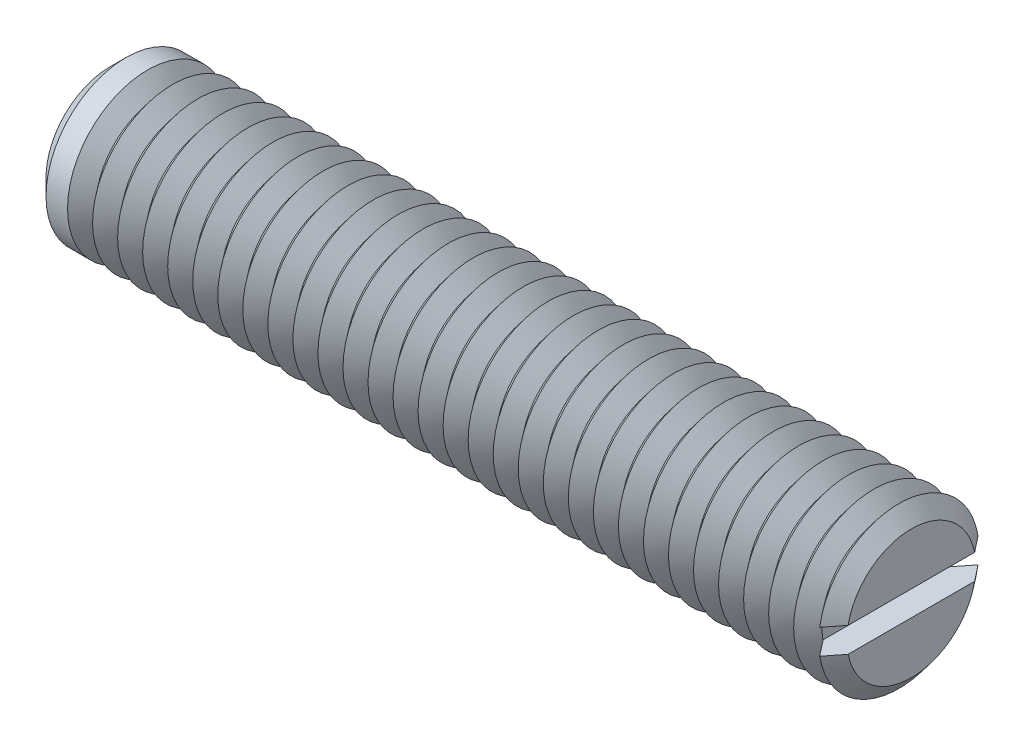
ISO-10303-21;
HEADER;
FILE_DESCRIPTION(('STEP AP214'),'2;1');
FILE_NAME('part.step','',(''),(''),'','','');
FILE_SCHEMA(('AUTOMOTIVE_DESIGN { 1 0 10303 214 1 1 1 1 }'));
ENDSEC;
DATA;
#1=APPLICATION_CONTEXT('core data for automotive mechanical design processes');
#2=APPLICATION_PROTOCOL_DEFINITION('international standard','automotive_design',2000,#1);
#3=PRODUCT_CONTEXT('',#1,'mechanical');
#4=PRODUCT('Part','Part','',(#3));
#5=PRODUCT_RELATED_PRODUCT_CATEGORY('part','',(#4));
#6=PRODUCT_DEFINITION_FORMATION('','',#4);
#7=PRODUCT_DEFINITION_CONTEXT('part definition',#1,'design');
#8=PRODUCT_DEFINITION('design','',#6,#7);
#9=PRODUCT_DEFINITION_SHAPE('','',#8);
#10=(LENGTH_UNIT() NAMED_UNIT(*) SI_UNIT(.MILLI.,.METRE.));
#11=(NAMED_UNIT(*) PLANE_ANGLE_UNIT() SI_UNIT($,.RADIAN.));
#12=(NAMED_UNIT(*) SI_UNIT($,.STERADIAN.) SOLID_ANGLE_UNIT());
#13=UNCERTAINTY_MEASURE_WITH_UNIT(LENGTH_MEASURE(1.E-05),#10,'distance_accuracy_value','');
#14=(GEOMETRIC_REPRESENTATION_CONTEXT(3) GLOBAL_UNCERTAINTY_ASSIGNED_CONTEXT((#13)) GLOBAL_UNIT_ASSIGNED_CONTEXT((#10,
#11,#12)) REPRESENTATION_CONTEXT('',''));
#15=CARTESIAN_POINT('',(0.,0.,0.));
#16=DIRECTION('',(0.,0.,1.));
#17=DIRECTION('',(1.,0.,0.));
#18=AXIS2_PLACEMENT_3D('',#15,#16,#17);
#19=CARTESIAN_POINT('',(19.375,0.,0.));
#20=DIRECTION('',(1.,0.,0.));
#21=DIRECTION('',(0.,0.,-1.));
#22=AXIS2_PLACEMENT_3D('',#19,#20,#21);
#23=CONICAL_SURFACE('',#22,4.,0.895664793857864);
#24=CARTESIAN_POINT('',(19.375,0.,0.));
#25=DIRECTION('',(-1.,0.,0.));
#26=DIRECTION('',(0.,0.,1.));
#27=AXIS2_PLACEMENT_3D('',#24,#25,#26);
#28=CIRCLE('',#27,4.);
#29=CARTESIAN_POINT('',(19.375,-0.625,-3.95087015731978));
#30=VERTEX_POINT('',#29);
#31=CARTESIAN_POINT('',(19.375,-0.625,3.95087015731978));
#32=VERTEX_POINT('',#31);
#33=EDGE_CURVE('E117',#30,#32,#28,.T.);
#34=ORIENTED_EDGE('',*,*,#33,.T.);
#35=CARTESIAN_POINT('',(23.1614902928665,-0.625,-8.70692181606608));
#36=CARTESIAN_POINT('',(22.9148555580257,-0.625,-8.39807520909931));
#37=CARTESIAN_POINT('',(22.6682552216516,-0.625,-8.08920109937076));
#38=CARTESIAN_POINT('',(22.1751408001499,-0.625,-7.47132164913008));
#39=CARTESIAN_POINT('',(21.9286267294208,-0.625,-7.1623162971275));
#40=CARTESIAN_POINT('',(21.4351922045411,-0.625,-6.54345822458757));
#41=CARTESIAN_POINT('',(21.1882721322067,-0.625,-6.23360519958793));
#42=CARTESIAN_POINT('',(20.6947157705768,-0.625,-5.61373487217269));
#43=CARTESIAN_POINT('',(20.4480794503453,-0.625,-5.30371759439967));
#44=CARTESIAN_POINT('',(20.0704817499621,-0.625,-4.82841623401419));
#45=CARTESIAN_POINT('',(19.9393680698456,-0.625,-4.6632531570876));
#46=CARTESIAN_POINT('',(19.6773052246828,-0.625,-4.33279290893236));
#47=CARTESIAN_POINT('',(19.5463560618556,-0.625,-4.16749573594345));
#48=CARTESIAN_POINT('',(19.2846416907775,-0.625,-3.83665276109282));
#49=CARTESIAN_POINT('',(19.1538765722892,-0.625,-3.67110688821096));
#50=CARTESIAN_POINT('',(18.892697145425,-0.625,-3.33975147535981));
#51=CARTESIAN_POINT('',(18.7622828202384,-0.625,-3.17394194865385));
#52=CARTESIAN_POINT('',(18.5022082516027,-0.625,-2.84217045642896));
#53=CARTESIAN_POINT('',(18.3725471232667,-0.625,-2.67620918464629));
#54=CARTESIAN_POINT('',(18.1140928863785,-0.625,-2.34356113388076));
#55=CARTESIAN_POINT('',(17.985299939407,-0.625,-2.17687422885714));
#56=CARTESIAN_POINT('',(17.7934479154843,-0.625,-1.92591523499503));
#57=CARTESIAN_POINT('',(17.7297426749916,-0.625,-1.84213757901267));
#58=CARTESIAN_POINT('',(17.6029724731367,-0.625,-1.67409978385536));
#59=CARTESIAN_POINT('',(17.5399075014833,-0.625,-1.58983965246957));
#60=CARTESIAN_POINT('',(17.4147785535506,-0.625,-1.42061659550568));
#61=CARTESIAN_POINT('',(17.3527142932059,-0.625,-1.33565388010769));
#62=CARTESIAN_POINT('',(17.2301881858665,-0.625,-1.16458302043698));
#63=CARTESIAN_POINT('',(17.1697261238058,-0.625,-1.0784750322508));
#64=CARTESIAN_POINT('',(17.0976838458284,-0.625,-0.972092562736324));
#65=CARTESIAN_POINT('',(17.0847024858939,-0.625,-0.95276797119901));
#66=CARTESIAN_POINT('',(17.0589128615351,-0.625,-0.914003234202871));
#67=CARTESIAN_POINT('',(17.0461046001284,-0.625,-0.894563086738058));
#68=CARTESIAN_POINT('',(17.0079767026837,-0.625,-0.836043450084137));
#69=CARTESIAN_POINT('',(16.9829560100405,-0.625,-0.796767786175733));
#70=CARTESIAN_POINT('',(16.9339776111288,-0.625,-0.717444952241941));
#71=CARTESIAN_POINT('',(16.9100221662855,-0.625,-0.677396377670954));
#72=CARTESIAN_POINT('',(16.8637207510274,-0.625,-0.596377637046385));
#73=CARTESIAN_POINT('',(16.8413744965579,-0.625,-0.555407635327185));
#74=CARTESIAN_POINT('',(16.8059952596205,-0.625,-0.485816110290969));
#75=CARTESIAN_POINT('',(16.7923049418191,-0.625,-0.457533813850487));
#76=CARTESIAN_POINT('',(16.766378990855,-0.625,-0.400313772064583));
#77=CARTESIAN_POINT('',(16.7541438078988,-0.625,-0.371375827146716));
#78=CARTESIAN_POINT('',(16.7204304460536,-0.625,-0.283641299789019));
#79=CARTESIAN_POINT('',(16.7017774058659,-0.625,-0.223617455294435));
#80=CARTESIAN_POINT('',(16.6847644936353,-0.625,-0.13910293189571));
#81=CARTESIAN_POINT('',(16.68099555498,-0.625,-0.115688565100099));
#82=CARTESIAN_POINT('',(16.6755004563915,-0.625,-0.0686260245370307));
#83=CARTESIAN_POINT('',(16.6737732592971,-0.625,-0.044977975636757));
#84=CARTESIAN_POINT('',(16.6724835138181,-0.625,0.00234331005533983));
#85=CARTESIAN_POINT('',(16.672917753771,-0.625,0.0260164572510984));
#86=CARTESIAN_POINT('',(16.6759063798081,-0.625,0.0732268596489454));
#87=CARTESIAN_POINT('',(16.6784611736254,-0.625,0.0967640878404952));
#88=CARTESIAN_POINT('',(16.691400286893,-0.625,0.182271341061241));
#89=CARTESIAN_POINT('',(16.707744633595,-0.625,0.243366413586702));
#90=CARTESIAN_POINT('',(16.7388887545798,-0.625,0.33266949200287));
#91=CARTESIAN_POINT('',(16.7504419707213,-0.625,0.36217480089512));
#92=CARTESIAN_POINT('',(16.7752210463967,-0.625,0.420481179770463));
#93=CARTESIAN_POINT('',(16.7884464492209,-0.625,0.449282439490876));
#94=CARTESIAN_POINT('',(16.8174677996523,-0.625,0.508972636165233));
#95=CARTESIAN_POINT('',(16.8333885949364,-0.625,0.539799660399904));
#96=CARTESIAN_POINT('',(16.8663425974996,-0.625,0.600856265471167));
#97=CARTESIAN_POINT('',(16.8833759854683,-0.625,0.631085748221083));
#98=CARTESIAN_POINT('',(16.9357348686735,-0.625,0.721100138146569));
#99=CARTESIAN_POINT('',(16.9722948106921,-0.625,0.780163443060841));
#100=CARTESIAN_POINT('',(17.0474296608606,-0.625,0.897183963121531));
#101=CARTESIAN_POINT('',(17.0860094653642,-0.625,0.955137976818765));
#102=CARTESIAN_POINT('',(17.1644096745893,-0.625,1.07020655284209));
#103=CARTESIAN_POINT('',(17.2042302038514,-0.625,1.12732103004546));
#104=CARTESIAN_POINT('',(17.2847841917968,-0.625,1.24108525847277));
#105=CARTESIAN_POINT('',(17.3255194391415,-0.625,1.29773373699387));
#106=CARTESIAN_POINT('',(17.4075780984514,-0.625,1.41061176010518));
#107=CARTESIAN_POINT('',(17.4489015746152,-0.625,1.4668412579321));
#108=CARTESIAN_POINT('',(17.5733456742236,-0.625,1.63486189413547));
#109=CARTESIAN_POINT('',(17.6570882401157,-0.625,1.74619171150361));
#110=CARTESIAN_POINT('',(17.8245788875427,-0.625,1.96690364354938));
#111=CARTESIAN_POINT('',(17.9083166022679,-0.625,2.0762936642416));
#112=CARTESIAN_POINT('',(18.0763821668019,-0.625,2.29462016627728));
#113=CARTESIAN_POINT('',(18.1607100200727,-0.625,2.40355664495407));
#114=CARTESIAN_POINT('',(18.4142762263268,-0.625,2.72992534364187));
#115=CARTESIAN_POINT('',(18.5840912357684,-0.625,2.94690900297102));
#116=CARTESIAN_POINT('',(18.9246141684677,-0.625,3.38042406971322));
#117=CARTESIAN_POINT('',(19.095322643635,-0.625,3.59695504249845));
#118=CARTESIAN_POINT('',(19.4371950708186,-0.625,4.02965109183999));
#119=CARTESIAN_POINT('',(19.6083590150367,-0.625,4.24581617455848));
#120=CARTESIAN_POINT('',(19.9504500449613,-0.625,4.67725748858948));
#121=CARTESIAN_POINT('',(20.121376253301,-0.625,4.89253441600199));
#122=CARTESIAN_POINT('',(20.4634226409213,-0.625,5.3229356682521));
#123=CARTESIAN_POINT('',(20.6345428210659,-0.625,5.53805999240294));
#124=CARTESIAN_POINT('',(21.1480384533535,-0.625,6.1831928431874));
#125=CARTESIAN_POINT('',(21.4906134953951,-0.625,6.6130424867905));
#126=CARTESIAN_POINT('',(21.9438892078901,-0.625,7.18140561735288));
#127=CARTESIAN_POINT('',(22.0544613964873,-0.625,7.32002163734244));
#128=CARTESIAN_POINT('',(22.2756363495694,-0.625,7.59723760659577));
#129=CARTESIAN_POINT('',(22.3862391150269,-0.625,7.73583755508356));
#130=CARTESIAN_POINT('',(22.6076076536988,-0.625,8.01319622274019));
#131=CARTESIAN_POINT('',(22.7183734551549,-0.625,8.15195491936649));
#132=CARTESIAN_POINT('',(22.939920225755,-0.625,8.42945184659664));
#133=CARTESIAN_POINT('',(23.0507011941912,-0.625,8.56819007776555));
#134=CARTESIAN_POINT('',(23.1614902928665,-0.625,8.70692181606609));
#135=B_SPLINE_CURVE_WITH_KNOTS('',3,(#35,#36,#37,#38,#39,#40,#41,#42,#43,#44,#45,#46,#47,#48,
#49,#50,#51,#52,#53,#54,#55,#56,#57,#58,#59,#60,#61,#62,#63,#64,#65,#66,#67,#68,#69,#70,#71,#72,
#73,#74,#75,#76,#77,#78,#79,#80,#81,#82,#83,#84,#85,#86,#87,#88,#89,#90,#91,#92,#93,#94,#95,#96,
#97,#98,#99,#100,#101,#102,#103,#104,#105,#106,#107,#108,#109,#110,#111,#112,#113,#114,#115,
#116,#117,#118,#119,#120,#121,#122,#123,#124,#125,#126,#127,#128,#129,#130,#131,#132,#133,#134),
.UNSPECIFIED.,.F.,.F.,(4,2,2,2,2,2,2,2,2,2,2,2,2,2,2,2,2,2,2,2,2,2,2,2,2,2,2,2,2,2,2,2,2,2,2,2,
2,2,2,2,2,2,2,2,2,2,2,2,2,4),(0.,1.18572103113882,2.37158837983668,3.56020338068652,
4.74867342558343,5.38130812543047,6.01395126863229,6.64683693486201,7.27969171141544,
7.91151062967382,8.54344406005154,8.85918511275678,9.17492108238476,9.49056578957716,
9.8061679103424,9.8760068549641,9.94584701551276,10.0855382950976,10.2255132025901,
10.3654633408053,10.4596856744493,10.5539370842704,10.741396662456,10.8124690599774,
10.8835053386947,10.9544360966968,11.0253804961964,11.2137597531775,11.3088096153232,
11.403833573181,11.5078935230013,11.6119704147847,11.8202840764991,12.0291284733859,
12.2379939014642,12.4473111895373,12.6566515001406,13.0745694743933,13.4878513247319,
13.9011356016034,14.7277337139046,15.5549232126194,16.3820986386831,17.2067434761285,
18.0313920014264,19.6803778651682,20.2123228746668,20.7442873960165,21.2769292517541,
21.8095515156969),.UNSPECIFIED.);
#136=CARTESIAN_POINT('',(18.75,-0.625,3.1581247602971));
#137=VERTEX_POINT('',#136);
#138=EDGE_CURVE('E109',#137,#32,#135,.T.);
#139=ORIENTED_EDGE('',*,*,#138,.F.);
#140=CARTESIAN_POINT('',(18.75,0.,0.));
#141=DIRECTION('',(-1.,0.,0.));
#142=DIRECTION('',(0.,0.,1.));
#143=AXIS2_PLACEMENT_3D('',#140,#141,#142);
#144=CIRCLE('',#143,3.2193752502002);
#145=CARTESIAN_POINT('',(18.75,-0.625,-3.1581247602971));
#146=VERTEX_POINT('',#145);
#147=EDGE_CURVE('E464',#146,#137,#144,.T.);
#148=ORIENTED_EDGE('',*,*,#147,.F.);
#149=EDGE_CURVE('E58',#30,#146,#135,.T.);
#150=ORIENTED_EDGE('',*,*,#149,.F.);
#151=EDGE_LOOP('',(#34,#139,#148,#150));
#152=FACE_BOUND('',#151,.T.);
#153=ADVANCED_FACE('F37',(#152),#23,.T.);
#154=CARTESIAN_POINT('',(19.375,0.625,3.95087015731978));
#155=VERTEX_POINT('',#154);
#156=CARTESIAN_POINT('',(19.375,0.625,-3.95087015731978));
#157=VERTEX_POINT('',#156);
#158=EDGE_CURVE('E100',#155,#157,#28,.T.);
#159=ORIENTED_EDGE('',*,*,#158,.T.);
#160=CARTESIAN_POINT('',(23.1614902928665,0.625,8.70692181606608));
#161=CARTESIAN_POINT('',(22.9148555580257,0.625,8.39807520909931));
#162=CARTESIAN_POINT('',(22.6682552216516,0.625,8.08920109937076));
#163=CARTESIAN_POINT('',(22.17514080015,0.625,7.47132164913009));
#164=CARTESIAN_POINT('',(21.9286267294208,0.625,7.16231629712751));
#165=CARTESIAN_POINT('',(21.4351922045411,0.625,6.54345822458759));
#166=CARTESIAN_POINT('',(21.1882721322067,0.625,6.23360519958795));
#167=CARTESIAN_POINT('',(20.6947157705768,0.625,5.61373487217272));
#168=CARTESIAN_POINT('',(20.4480794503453,0.625,5.3037175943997));
#169=CARTESIAN_POINT('',(20.0704817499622,0.625,4.82841623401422));
#170=CARTESIAN_POINT('',(19.9393680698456,0.625,4.66325315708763));
#171=CARTESIAN_POINT('',(19.6773052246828,0.625,4.33279290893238));
#172=CARTESIAN_POINT('',(19.5463560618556,0.625,4.16749573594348));
#173=CARTESIAN_POINT('',(19.2846416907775,0.625,3.83665276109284));
#174=CARTESIAN_POINT('',(19.1538765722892,0.625,3.67110688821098));
#175=CARTESIAN_POINT('',(18.892697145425,0.625,3.33975147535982));
#176=CARTESIAN_POINT('',(18.7622828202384,0.625,3.17394194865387));
#177=CARTESIAN_POINT('',(18.5022082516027,0.625,2.84217045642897));
#178=CARTESIAN_POINT('',(18.3725471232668,0.625,2.6762091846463));
#179=CARTESIAN_POINT('',(18.1140928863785,0.625,2.34356113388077));
#180=CARTESIAN_POINT('',(17.985299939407,0.625,2.17687422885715));
#181=CARTESIAN_POINT('',(17.7934479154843,0.625,1.92591523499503));
#182=CARTESIAN_POINT('',(17.7297426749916,0.625,1.84213757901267));
#183=CARTESIAN_POINT('',(17.6029724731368,0.625,1.67409978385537));
#184=CARTESIAN_POINT('',(17.5399075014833,0.625,1.58983965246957));
#185=CARTESIAN_POINT('',(17.4147785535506,0.625,1.42061659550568));
#186=CARTESIAN_POINT('',(17.3527142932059,0.625,1.33565388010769));
#187=CARTESIAN_POINT('',(17.2301881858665,0.625,1.16458302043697));
#188=CARTESIAN_POINT('',(17.1697261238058,0.625,1.0784750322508));
#189=CARTESIAN_POINT('',(17.0976838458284,0.625,0.97209256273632));
#190=CARTESIAN_POINT('',(17.0847024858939,0.625,0.952767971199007));
#191=CARTESIAN_POINT('',(17.058912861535,0.625,0.914003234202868));
#192=CARTESIAN_POINT('',(17.0461046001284,0.625,0.894563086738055));
#193=CARTESIAN_POINT('',(17.0079767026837,0.625,0.836043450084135));
#194=CARTESIAN_POINT('',(16.9829560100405,0.625,0.796767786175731));
#195=CARTESIAN_POINT('',(16.9339776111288,0.625,0.71744495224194));
#196=CARTESIAN_POINT('',(16.9100221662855,0.625,0.677396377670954));
#197=CARTESIAN_POINT('',(16.8637207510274,0.625,0.596377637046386));
#198=CARTESIAN_POINT('',(16.8413744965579,0.625,0.555407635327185));
#199=CARTESIAN_POINT('',(16.8059952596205,0.625,0.485816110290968));
#200=CARTESIAN_POINT('',(16.7923049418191,0.625,0.457533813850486));
#201=CARTESIAN_POINT('',(16.766378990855,0.625,0.400313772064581));
#202=CARTESIAN_POINT('',(16.7541438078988,0.625,0.371375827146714));
#203=CARTESIAN_POINT('',(16.7204304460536,0.625,0.283641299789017));
#204=CARTESIAN_POINT('',(16.7017774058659,0.625,0.223617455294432));
#205=CARTESIAN_POINT('',(16.6847644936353,0.625,0.139102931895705));
#206=CARTESIAN_POINT('',(16.68099555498,0.625,0.115688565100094));
#207=CARTESIAN_POINT('',(16.6755004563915,0.625,0.0686260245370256));
#208=CARTESIAN_POINT('',(16.6737732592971,0.625,0.0449779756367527));
#209=CARTESIAN_POINT('',(16.6724835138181,0.625,-0.00234331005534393));
#210=CARTESIAN_POINT('',(16.672917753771,0.625,-0.026016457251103));
#211=CARTESIAN_POINT('',(16.6759063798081,0.625,-0.0732268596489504));
#212=CARTESIAN_POINT('',(16.6784611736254,0.625,-0.0967640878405));
#213=CARTESIAN_POINT('',(16.691400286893,0.625,-0.182271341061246));
#214=CARTESIAN_POINT('',(16.707744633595,0.625,-0.243366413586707));
#215=CARTESIAN_POINT('',(16.7388887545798,0.625,-0.332669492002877));
#216=CARTESIAN_POINT('',(16.7504419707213,0.625,-0.362174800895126));
#217=CARTESIAN_POINT('',(16.7752210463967,0.625,-0.42048117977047));
#218=CARTESIAN_POINT('',(16.7884464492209,0.625,-0.449282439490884));
#219=CARTESIAN_POINT('',(16.8174677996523,0.625,-0.508972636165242));
#220=CARTESIAN_POINT('',(16.8333885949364,0.625,-0.539799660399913));
#221=CARTESIAN_POINT('',(16.8663425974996,0.625,-0.600856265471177));
#222=CARTESIAN_POINT('',(16.8833759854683,0.625,-0.631085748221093));
#223=CARTESIAN_POINT('',(16.9357348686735,0.625,-0.721100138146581));
#224=CARTESIAN_POINT('',(16.9722948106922,0.625,-0.780163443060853));
#225=CARTESIAN_POINT('',(17.0474296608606,0.625,-0.897183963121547));
#226=CARTESIAN_POINT('',(17.0860094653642,0.625,-0.955137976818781));
#227=CARTESIAN_POINT('',(17.1644096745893,0.625,-1.07020655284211));
#228=CARTESIAN_POINT('',(17.2042302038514,0.625,-1.12732103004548));
#229=CARTESIAN_POINT('',(17.2847841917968,0.625,-1.24108525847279));
#230=CARTESIAN_POINT('',(17.3255194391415,0.625,-1.29773373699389));
#231=CARTESIAN_POINT('',(17.4075780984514,0.625,-1.41061176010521));
#232=CARTESIAN_POINT('',(17.4489015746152,0.625,-1.46684125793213));
#233=CARTESIAN_POINT('',(17.5733456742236,0.625,-1.63486189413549));
#234=CARTESIAN_POINT('',(17.6570882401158,0.625,-1.74619171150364));
#235=CARTESIAN_POINT('',(17.8245788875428,0.625,-1.96690364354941));
#236=CARTESIAN_POINT('',(17.9083166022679,0.625,-2.07629366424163));
#237=CARTESIAN_POINT('',(18.0763821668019,0.625,-2.29462016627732));
#238=CARTESIAN_POINT('',(18.1607100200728,0.625,-2.40355664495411));
#239=CARTESIAN_POINT('',(18.4142762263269,0.625,-2.72992534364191));
#240=CARTESIAN_POINT('',(18.5840912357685,0.625,-2.94690900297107));
#241=CARTESIAN_POINT('',(18.9246141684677,0.625,-3.38042406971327));
#242=CARTESIAN_POINT('',(19.095322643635,0.625,-3.5969550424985));
#243=CARTESIAN_POINT('',(19.4371950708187,0.625,-4.02965109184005));
#244=CARTESIAN_POINT('',(19.6083590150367,0.625,-4.24581617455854));
#245=CARTESIAN_POINT('',(19.9504500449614,0.625,-4.67725748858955));
#246=CARTESIAN_POINT('',(20.1213762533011,0.625,-4.89253441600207));
#247=CARTESIAN_POINT('',(20.4634226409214,0.625,-5.32293566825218));
#248=CARTESIAN_POINT('',(20.634542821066,0.625,-5.53805999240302));
#249=CARTESIAN_POINT('',(21.1480384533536,0.625,-6.18319284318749));
#250=CARTESIAN_POINT('',(21.4906134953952,0.625,-6.6130424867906));
#251=CARTESIAN_POINT('',(21.9438892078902,0.625,-7.18140561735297));
#252=CARTESIAN_POINT('',(22.0544613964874,0.625,-7.32002163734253));
#253=CARTESIAN_POINT('',(22.2756363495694,0.625,-7.59723760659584));
#254=CARTESIAN_POINT('',(22.386239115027,0.625,-7.73583755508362));
#255=CARTESIAN_POINT('',(22.6076076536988,0.625,-8.01319622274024));
#256=CARTESIAN_POINT('',(22.7183734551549,0.625,-8.15195491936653));
#257=CARTESIAN_POINT('',(22.939920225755,0.625,-8.42945184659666));
#258=CARTESIAN_POINT('',(23.0507011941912,0.625,-8.56819007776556));
#259=CARTESIAN_POINT('',(23.1614902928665,0.625,-8.70692181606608));
#260=B_SPLINE_CURVE_WITH_KNOTS('',3,(#160,#161,#162,#163,#164,#165,#166,#167,#168,#169,#170,
#171,#172,#173,#174,#175,#176,#177,#178,#179,#180,#181,#182,#183,#184,#185,#186,#187,#188,#189,
#190,#191,#192,#193,#194,#195,#196,#197,#198,#199,#200,#201,#202,#203,#204,#205,#206,#207,#208,
#209,#210,#211,#212,#213,#214,#215,#216,#217,#218,#219,#220,#221,#222,#223,#224,#225,#226,#227,
#228,#229,#230,#231,#232,#233,#234,#235,#236,#237,#238,#239,#240,#241,#242,#243,#244,#245,#246,
#247,#248,#249,#250,#251,#252,#253,#254,#255,#256,#257,#258,#259),.UNSPECIFIED.,.F.,.F.,(4,2,2,
2,2,2,2,2,2,2,2,2,2,2,2,2,2,2,2,2,2,2,2,2,2,2,2,2,2,2,2,2,2,2,2,2,2,2,2,2,2,2,2,2,2,2,2,2,2,4),
(0.,1.1857210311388,2.37158837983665,3.56020338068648,4.74867342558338,5.38130812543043,
6.01395126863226,6.64683693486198,7.27969171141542,7.91151062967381,8.54344406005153,
8.85918511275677,9.17492108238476,9.49056578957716,9.8061679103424,9.8760068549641,
9.94584701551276,10.0855382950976,10.2255132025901,10.3654633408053,10.4596856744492,
10.5539370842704,10.741396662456,10.8124690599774,10.8835053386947,10.9544360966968,
11.0253804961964,11.2137597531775,11.3088096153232,11.403833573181,11.5078935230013,
11.6119704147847,11.8202840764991,12.0291284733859,12.2379939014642,12.4473111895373,
12.6566515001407,13.0745694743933,13.4878513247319,13.9011356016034,14.7277337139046,
15.5549232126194,16.3820986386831,17.2067434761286,18.0313920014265,19.6803778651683,
20.2123228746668,20.7442873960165,21.2769292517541,21.8095515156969),.UNSPECIFIED.);
#261=CARTESIAN_POINT('',(18.75,0.625,-3.1581247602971));
#262=VERTEX_POINT('',#261);
#263=EDGE_CURVE('E110',#262,#157,#260,.T.);
#264=ORIENTED_EDGE('',*,*,#263,.F.);
#265=CARTESIAN_POINT('',(18.75,0.625,3.1581247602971));
#266=VERTEX_POINT('',#265);
#267=EDGE_CURVE('E103',#266,#262,#144,.T.);
#268=ORIENTED_EDGE('',*,*,#267,.F.);
#269=EDGE_CURVE('E97',#155,#266,#260,.T.);
#270=ORIENTED_EDGE('',*,*,#269,.F.);
#271=EDGE_LOOP('',(#159,#264,#268,#270));
#272=FACE_BOUND('',#271,.T.);
#273=ADVANCED_FACE('F99',(#272),#23,.T.);
#274=CARTESIAN_POINT('',(18.75,0.,0.));
#275=DIRECTION('',(-1.,0.,0.));
#276=DIRECTION('',(0.,0.,1.));
#277=AXIS2_PLACEMENT_3D('',#274,#275,#276);
#278=CONICAL_SURFACE('',#277,3.2193752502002,0.895664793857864);
#279=CARTESIAN_POINT('',(18.125,0.,0.));
#280=DIRECTION('',(-1.,0.,0.));
#281=DIRECTION('',(0.,0.,1.));
#282=AXIS2_PLACEMENT_3D('',#279,#280,#281);
#283=CIRCLE('',#282,4.);
#284=CARTESIAN_POINT('',(18.125,0.,4.));
#285=VERTEX_POINT('',#284);
#286=EDGE_CURVE('E449',#285,#285,#283,.T.);
#287=ORIENTED_EDGE('',*,*,#286,.F.);
#288=EDGE_LOOP('',(#287));
#289=FACE_BOUND('',#288,.T.);
#290=ORIENTED_EDGE('',*,*,#267,.T.);
#291=EDGE_CURVE('E457',#262,#146,#144,.T.);
#292=ORIENTED_EDGE('',*,*,#291,.T.);
#293=ORIENTED_EDGE('',*,*,#147,.T.);
#294=EDGE_CURVE('E455',#137,#266,#144,.T.);
#295=ORIENTED_EDGE('',*,*,#294,.T.);
#296=EDGE_LOOP('',(#290,#292,#293,#295));
#297=FACE_BOUND('',#296,.T.);
#298=ADVANCED_FACE('F168',(#289,#297),#278,.T.);
#299=CARTESIAN_POINT('',(20.,0.,0.));
#300=DIRECTION('',(1.,0.,0.));
#301=DIRECTION('',(0.,0.,-1.));
#302=AXIS2_PLACEMENT_3D('',#299,#300,#301);
#303=PLANE('',#302);
#304=CARTESIAN_POINT('',(20.,0.,0.));
#305=DIRECTION('',(-1.,0.,0.));
#306=DIRECTION('',(0.,0.,1.));
#307=AXIS2_PLACEMENT_3D('',#304,#305,#306);
#308=CIRCLE('',#307,3.2193752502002);
#309=CARTESIAN_POINT('',(20.,0.625,3.1581247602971));
#310=VERTEX_POINT('',#309);
#311=CARTESIAN_POINT('',(20.,0.625,-3.1581247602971));
#312=VERTEX_POINT('',#311);
#313=EDGE_CURVE('E160',#310,#312,#308,.T.);
#314=ORIENTED_EDGE('',*,*,#313,.F.);
#315=DIRECTION('',(0.,0.,1.));
#316=VECTOR('',#315,1.);
#317=CARTESIAN_POINT('',(20.,0.625,0.));
#318=LINE('',#317,#316);
#319=EDGE_CURVE('E122',#312,#310,#318,.T.);
#320=ORIENTED_EDGE('',*,*,#319,.F.);
#321=EDGE_LOOP('',(#314,#320));
#322=FACE_BOUND('',#321,.T.);
#323=ADVANCED_FACE('F172',(#322),#303,.T.);
#324=CARTESIAN_POINT('',(20.,-0.625,-3.1581247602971));
#325=VERTEX_POINT('',#324);
#326=CARTESIAN_POINT('',(20.,-0.625,3.1581247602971));
#327=VERTEX_POINT('',#326);
#328=EDGE_CURVE('E66',#325,#327,#308,.T.);
#329=ORIENTED_EDGE('',*,*,#328,.F.);
#330=DIRECTION('',(0.,0.,-1.));
#331=VECTOR('',#330,1.);
#332=CARTESIAN_POINT('',(20.,-0.625,0.));
#333=LINE('',#332,#331);
#334=EDGE_CURVE('E136',#327,#325,#333,.T.);
#335=ORIENTED_EDGE('',*,*,#334,.F.);
#336=EDGE_LOOP('',(#329,#335));
#337=FACE_BOUND('',#336,.T.);
#338=ADVANCED_FACE('F200',(#337),#303,.T.);
#339=CARTESIAN_POINT('',(20.,0.,0.));
#340=DIRECTION('',(-1.,0.,0.));
#341=DIRECTION('',(0.,0.,1.));
#342=AXIS2_PLACEMENT_3D('',#339,#340,#341);
#343=CONICAL_SURFACE('',#342,3.2193752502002,0.895664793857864);
#344=ORIENTED_EDGE('',*,*,#158,.F.);
#345=CARTESIAN_POINT('',(15.5885097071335,0.625,-8.70692181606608));
#346=CARTESIAN_POINT('',(15.8351444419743,0.625,-8.39807520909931));
#347=CARTESIAN_POINT('',(16.0817447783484,0.625,-8.08920109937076));
#348=CARTESIAN_POINT('',(16.57485919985,0.625,-7.47132164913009));
#349=CARTESIAN_POINT('',(16.8213732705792,0.625,-7.16231629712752));
#350=CARTESIAN_POINT('',(17.3148077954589,0.625,-6.54345822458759));
#351=CARTESIAN_POINT('',(17.5617278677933,0.625,-6.23360519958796));
#352=CARTESIAN_POINT('',(18.0552842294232,0.625,-5.61373487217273));
#353=CARTESIAN_POINT('',(18.3019205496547,0.625,-5.30371759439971));
#354=CARTESIAN_POINT('',(18.6795182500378,0.625,-4.82841623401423));
#355=CARTESIAN_POINT('',(18.8106319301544,0.625,-4.66325315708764));
#356=CARTESIAN_POINT('',(19.0726947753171,0.625,-4.33279290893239));
#357=CARTESIAN_POINT('',(19.2036439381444,0.625,-4.16749573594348));
#358=CARTESIAN_POINT('',(19.4653583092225,0.625,-3.83665276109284));
#359=CARTESIAN_POINT('',(19.5961234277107,0.625,-3.67110688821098));
#360=CARTESIAN_POINT('',(19.857302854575,0.625,-3.33975147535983));
#361=CARTESIAN_POINT('',(19.9877171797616,0.625,-3.17394194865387));
#362=CARTESIAN_POINT('',(20.2477917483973,0.625,-2.84217045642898));
#363=CARTESIAN_POINT('',(20.3774528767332,0.625,-2.6762091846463));
#364=CARTESIAN_POINT('',(20.6359071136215,0.625,-2.34356113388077));
#365=CARTESIAN_POINT('',(20.764700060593,0.625,-2.17687422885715));
#366=CARTESIAN_POINT('',(20.9565520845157,0.625,-1.92591523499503));
#367=CARTESIAN_POINT('',(21.0202573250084,0.625,-1.84213757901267));
#368=CARTESIAN_POINT('',(21.1470275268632,0.625,-1.67409978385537));
#369=CARTESIAN_POINT('',(21.2100924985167,0.625,-1.58983965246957));
#370=CARTESIAN_POINT('',(21.3352214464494,0.625,-1.42061659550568));
#371=CARTESIAN_POINT('',(21.3972857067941,0.625,-1.33565388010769));
#372=CARTESIAN_POINT('',(21.5198118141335,0.625,-1.16458302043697));
#373=CARTESIAN_POINT('',(21.5802738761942,0.625,-1.0784750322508));
#374=CARTESIAN_POINT('',(21.6523161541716,0.625,-0.97209256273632));
#375=CARTESIAN_POINT('',(21.6652975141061,0.625,-0.952767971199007));
#376=CARTESIAN_POINT('',(21.6910871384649,0.625,-0.914003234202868));
#377=CARTESIAN_POINT('',(21.7038953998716,0.625,-0.894563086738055));
#378=CARTESIAN_POINT('',(21.7420232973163,0.625,-0.836043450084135));
#379=CARTESIAN_POINT('',(21.7670439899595,0.625,-0.796767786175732));
#380=CARTESIAN_POINT('',(21.8160223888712,0.625,-0.71744495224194));
#381=CARTESIAN_POINT('',(21.8399778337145,0.625,-0.677396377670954));
#382=CARTESIAN_POINT('',(21.8862792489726,0.625,-0.596377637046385));
#383=CARTESIAN_POINT('',(21.9086255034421,0.625,-0.555407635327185));
#384=CARTESIAN_POINT('',(21.9440047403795,0.625,-0.485816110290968));
#385=CARTESIAN_POINT('',(21.9576950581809,0.625,-0.457533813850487));
#386=CARTESIAN_POINT('',(21.983621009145,0.625,-0.400313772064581));
#387=CARTESIAN_POINT('',(21.9958561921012,0.625,-0.371375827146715));
#388=CARTESIAN_POINT('',(22.0295695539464,0.625,-0.283641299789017));
#389=CARTESIAN_POINT('',(22.0482225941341,0.625,-0.223617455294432));
#390=CARTESIAN_POINT('',(22.0652355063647,0.625,-0.139102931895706));
#391=CARTESIAN_POINT('',(22.06900444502,0.625,-0.115688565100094));
#392=CARTESIAN_POINT('',(22.0744995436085,0.625,-0.0686260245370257));
#393=CARTESIAN_POINT('',(22.0762267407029,0.625,-0.0449779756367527));
#394=CARTESIAN_POINT('',(22.0775164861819,0.625,0.00234331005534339));
#395=CARTESIAN_POINT('',(22.077082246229,0.625,0.0260164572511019));
#396=CARTESIAN_POINT('',(22.0740936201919,0.625,0.0732268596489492));
#397=CARTESIAN_POINT('',(22.0715388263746,0.625,0.0967640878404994));
#398=CARTESIAN_POINT('',(22.058599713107,0.625,0.182271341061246));
#399=CARTESIAN_POINT('',(22.042255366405,0.625,0.243366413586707));
#400=CARTESIAN_POINT('',(22.0111112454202,0.625,0.332669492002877));
#401=CARTESIAN_POINT('',(21.9995580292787,0.625,0.362174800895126));
#402=CARTESIAN_POINT('',(21.9747789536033,0.625,0.42048117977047));
#403=CARTESIAN_POINT('',(21.9615535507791,0.625,0.449282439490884));
#404=CARTESIAN_POINT('',(21.9325322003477,0.625,0.508972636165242));
#405=CARTESIAN_POINT('',(21.9166114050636,0.625,0.539799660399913));
#406=CARTESIAN_POINT('',(21.8836574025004,0.625,0.600856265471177));
#407=CARTESIAN_POINT('',(21.8666240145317,0.625,0.631085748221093));
#408=CARTESIAN_POINT('',(21.8142651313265,0.625,0.721100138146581));
#409=CARTESIAN_POINT('',(21.7777051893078,0.625,0.780163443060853));
#410=CARTESIAN_POINT('',(21.7025703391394,0.625,0.897183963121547));
#411=CARTESIAN_POINT('',(21.6639905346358,0.625,0.955137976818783));
#412=CARTESIAN_POINT('',(21.5855903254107,0.625,1.07020655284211));
#413=CARTESIAN_POINT('',(21.5457697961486,0.625,1.12732103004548));
#414=CARTESIAN_POINT('',(21.4652158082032,0.625,1.24108525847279));
#415=CARTESIAN_POINT('',(21.4244805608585,0.625,1.29773373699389));
#416=CARTESIAN_POINT('',(21.3424219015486,0.625,1.41061176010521));
#417=CARTESIAN_POINT('',(21.3010984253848,0.625,1.46684125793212));
#418=CARTESIAN_POINT('',(21.1766543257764,0.625,1.63486189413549));
#419=CARTESIAN_POINT('',(21.0929117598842,0.625,1.74619171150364));
#420=CARTESIAN_POINT('',(20.9254211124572,0.625,1.96690364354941));
#421=CARTESIAN_POINT('',(20.8416833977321,0.625,2.07629366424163));
#422=CARTESIAN_POINT('',(20.6736178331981,0.625,2.29462016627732));
#423=CARTESIAN_POINT('',(20.5892899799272,0.625,2.40355664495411));
#424=CARTESIAN_POINT('',(20.3357237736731,0.625,2.72992534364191));
#425=CARTESIAN_POINT('',(20.1659087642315,0.625,2.94690900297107));
#426=CARTESIAN_POINT('',(19.8253858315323,0.625,3.38042406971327));
#427=CARTESIAN_POINT('',(19.654677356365,0.625,3.59695504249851));
#428=CARTESIAN_POINT('',(19.3128049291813,0.625,4.02965109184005));
#429=CARTESIAN_POINT('',(19.1416409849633,0.625,4.24581617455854));
#430=CARTESIAN_POINT('',(18.7995499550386,0.625,4.67725748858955));
#431=CARTESIAN_POINT('',(18.6286237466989,0.625,4.89253441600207));
#432=CARTESIAN_POINT('',(18.2865773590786,0.625,5.32293566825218));
#433=CARTESIAN_POINT('',(18.115457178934,0.625,5.53805999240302));
#434=CARTESIAN_POINT('',(17.6019615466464,0.625,6.18319284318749));
#435=CARTESIAN_POINT('',(17.2593865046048,0.625,6.61304248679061));
#436=CARTESIAN_POINT('',(16.8061107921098,0.625,7.18140561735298));
#437=CARTESIAN_POINT('',(16.6955386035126,0.625,7.32002163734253));
#438=CARTESIAN_POINT('',(16.4743636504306,0.625,7.59723760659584));
#439=CARTESIAN_POINT('',(16.363760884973,0.625,7.73583755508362));
#440=CARTESIAN_POINT('',(16.1423923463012,0.625,8.01319622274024));
#441=CARTESIAN_POINT('',(16.0316265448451,0.625,8.15195491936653));
#442=CARTESIAN_POINT('',(15.810079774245,0.625,8.42945184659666));
#443=CARTESIAN_POINT('',(15.6992988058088,0.625,8.56819007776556));
#444=CARTESIAN_POINT('',(15.5885097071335,0.625,8.70692181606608));
#445=B_SPLINE_CURVE_WITH_KNOTS('',3,(#345,#346,#347,#348,#349,#350,#351,#352,#353,#354,#355,
#356,#357,#358,#359,#360,#361,#362,#363,#364,#365,#366,#367,#368,#369,#370,#371,#372,#373,#374,
#375,#376,#377,#378,#379,#380,#381,#382,#383,#384,#385,#386,#387,#388,#389,#390,#391,#392,#393,
#394,#395,#396,#397,#398,#399,#400,#401,#402,#403,#404,#405,#406,#407,#408,#409,#410,#411,#412,
#413,#414,#415,#416,#417,#418,#419,#420,#421,#422,#423,#424,#425,#426,#427,#428,#429,#430,#431,
#432,#433,#434,#435,#436,#437,#438,#439,#440,#441,#442,#443,#444),.UNSPECIFIED.,.F.,.F.,(4,2,2,
2,2,2,2,2,2,2,2,2,2,2,2,2,2,2,2,2,2,2,2,2,2,2,2,2,2,2,2,2,2,2,2,2,2,2,2,2,2,2,2,2,2,2,2,2,2,4),
(0.,1.18572103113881,2.37158837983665,3.56020338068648,4.74867342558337,5.38130812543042,
6.01395126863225,6.64683693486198,7.27969171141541,7.9115106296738,8.54344406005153,
8.85918511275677,9.17492108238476,9.49056578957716,9.8061679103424,9.87600685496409,
9.94584701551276,10.0855382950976,10.2255132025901,10.3654633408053,10.4596856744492,
10.5539370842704,10.741396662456,10.8124690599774,10.8835053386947,10.9544360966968,
11.0253804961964,11.2137597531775,11.3088096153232,11.403833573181,11.5078935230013,
11.6119704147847,11.8202840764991,12.0291284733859,12.2379939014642,12.4473111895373,
12.6566515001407,13.0745694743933,13.4878513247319,13.9011356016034,14.7277337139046,
15.5549232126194,16.3820986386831,17.2067434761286,18.0313920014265,19.6803778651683,
20.2123228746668,20.7442873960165,21.2769292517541,21.8095515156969),.UNSPECIFIED.);
#446=EDGE_CURVE('E41',#310,#155,#445,.T.);
#447=ORIENTED_EDGE('',*,*,#446,.F.);
#448=ORIENTED_EDGE('',*,*,#313,.T.);
#449=EDGE_CURVE('E11',#157,#312,#445,.T.);
#450=ORIENTED_EDGE('',*,*,#449,.F.);
#451=EDGE_LOOP('',(#344,#447,#448,#450));
#452=FACE_BOUND('',#451,.T.);
#453=ADVANCED_FACE('F114',(#452),#343,.T.);
#454=CARTESIAN_POINT('',(20.,0.625,-6.));
#455=DIRECTION('',(0.,1.,0.));
#456=DIRECTION('',(0.,0.,1.));
#457=AXIS2_PLACEMENT_3D('',#454,#455,#456);
#458=PLANE('',#457);
#459=ORIENTED_EDGE('',*,*,#446,.T.);
#460=ORIENTED_EDGE('',*,*,#269,.T.);
#461=DIRECTION('',(0.,0.,1.));
#462=VECTOR('',#461,1.);
#463=CARTESIAN_POINT('',(18.75,0.625,-6.));
#464=LINE('',#463,#462);
#465=EDGE_CURVE('E145',#262,#266,#464,.T.);
#466=ORIENTED_EDGE('',*,*,#465,.F.);
#467=ORIENTED_EDGE('',*,*,#263,.T.);
#468=ORIENTED_EDGE('',*,*,#449,.T.);
#469=ORIENTED_EDGE('',*,*,#319,.T.);
#470=EDGE_LOOP('',(#459,#460,#466,#467,#468,#469));
#471=FACE_BOUND('',#470,.T.);
#472=ADVANCED_FACE('F120',(#471),#458,.F.);
#473=ORIENTED_EDGE('',*,*,#33,.F.);
#474=CARTESIAN_POINT('',(15.5885097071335,-0.625,8.70692181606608));
#475=CARTESIAN_POINT('',(15.8351444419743,-0.625,8.39807520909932));
#476=CARTESIAN_POINT('',(16.0817447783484,-0.625,8.08920109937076));
#477=CARTESIAN_POINT('',(16.57485919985,-0.625,7.47132164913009));
#478=CARTESIAN_POINT('',(16.8213732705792,-0.625,7.16231629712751));
#479=CARTESIAN_POINT('',(17.3148077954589,-0.625,6.54345822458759));
#480=CARTESIAN_POINT('',(17.5617278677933,-0.625,6.23360519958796));
#481=CARTESIAN_POINT('',(18.0552842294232,-0.625,5.61373487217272));
#482=CARTESIAN_POINT('',(18.3019205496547,-0.625,5.3037175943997));
#483=CARTESIAN_POINT('',(18.6795182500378,-0.625,4.82841623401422));
#484=CARTESIAN_POINT('',(18.8106319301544,-0.625,4.66325315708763));
#485=CARTESIAN_POINT('',(19.0726947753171,-0.625,4.33279290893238));
#486=CARTESIAN_POINT('',(19.2036439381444,-0.625,4.16749573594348));
#487=CARTESIAN_POINT('',(19.4653583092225,-0.625,3.83665276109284));
#488=CARTESIAN_POINT('',(19.5961234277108,-0.625,3.67110688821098));
#489=CARTESIAN_POINT('',(19.857302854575,-0.625,3.33975147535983));
#490=CARTESIAN_POINT('',(19.9877171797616,-0.625,3.17394194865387));
#491=CARTESIAN_POINT('',(20.2477917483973,-0.625,2.84217045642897));
#492=CARTESIAN_POINT('',(20.3774528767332,-0.625,2.6762091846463));
#493=CARTESIAN_POINT('',(20.6359071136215,-0.625,2.34356113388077));
#494=CARTESIAN_POINT('',(20.764700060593,-0.625,2.17687422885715));
#495=CARTESIAN_POINT('',(20.9565520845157,-0.625,1.92591523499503));
#496=CARTESIAN_POINT('',(21.0202573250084,-0.625,1.84213757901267));
#497=CARTESIAN_POINT('',(21.1470275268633,-0.625,1.67409978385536));
#498=CARTESIAN_POINT('',(21.2100924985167,-0.625,1.58983965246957));
#499=CARTESIAN_POINT('',(21.3352214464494,-0.625,1.42061659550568));
#500=CARTESIAN_POINT('',(21.3972857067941,-0.625,1.33565388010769));
#501=CARTESIAN_POINT('',(21.5198118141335,-0.625,1.16458302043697));
#502=CARTESIAN_POINT('',(21.5802738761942,-0.625,1.0784750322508));
#503=CARTESIAN_POINT('',(21.6523161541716,-0.625,0.97209256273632));
#504=CARTESIAN_POINT('',(21.6652975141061,-0.625,0.952767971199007));
#505=CARTESIAN_POINT('',(21.6910871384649,-0.625,0.914003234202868));
#506=CARTESIAN_POINT('',(21.7038953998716,-0.625,0.894563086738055));
#507=CARTESIAN_POINT('',(21.7420232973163,-0.625,0.836043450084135));
#508=CARTESIAN_POINT('',(21.7670439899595,-0.625,0.796767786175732));
#509=CARTESIAN_POINT('',(21.8160223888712,-0.625,0.71744495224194));
#510=CARTESIAN_POINT('',(21.8399778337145,-0.625,0.677396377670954));
#511=CARTESIAN_POINT('',(21.8862792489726,-0.625,0.596377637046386));
#512=CARTESIAN_POINT('',(21.9086255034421,-0.625,0.555407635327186));
#513=CARTESIAN_POINT('',(21.9440047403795,-0.625,0.485816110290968));
#514=CARTESIAN_POINT('',(21.9576950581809,-0.625,0.457533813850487));
#515=CARTESIAN_POINT('',(21.983621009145,-0.625,0.400313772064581));
#516=CARTESIAN_POINT('',(21.9958561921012,-0.625,0.371375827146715));
#517=CARTESIAN_POINT('',(22.0295695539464,-0.625,0.283641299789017));
#518=CARTESIAN_POINT('',(22.0482225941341,-0.625,0.223617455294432));
#519=CARTESIAN_POINT('',(22.0652355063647,-0.625,0.139102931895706));
#520=CARTESIAN_POINT('',(22.06900444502,-0.625,0.115688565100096));
#521=CARTESIAN_POINT('',(22.0744995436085,-0.625,0.0686260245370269));
#522=CARTESIAN_POINT('',(22.0762267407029,-0.625,0.0449779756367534));
#523=CARTESIAN_POINT('',(22.0775164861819,-0.625,-0.00234331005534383));
#524=CARTESIAN_POINT('',(22.077082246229,-0.625,-0.0260164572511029));
#525=CARTESIAN_POINT('',(22.0740936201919,-0.625,-0.0732268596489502));
#526=CARTESIAN_POINT('',(22.0715388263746,-0.625,-0.0967640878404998));
#527=CARTESIAN_POINT('',(22.058599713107,-0.625,-0.182271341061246));
#528=CARTESIAN_POINT('',(22.042255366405,-0.625,-0.243366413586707));
#529=CARTESIAN_POINT('',(22.0111112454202,-0.625,-0.332669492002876));
#530=CARTESIAN_POINT('',(21.9995580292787,-0.625,-0.362174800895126));
#531=CARTESIAN_POINT('',(21.9747789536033,-0.625,-0.420481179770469));
#532=CARTESIAN_POINT('',(21.9615535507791,-0.625,-0.449282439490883));
#533=CARTESIAN_POINT('',(21.9325322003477,-0.625,-0.508972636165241));
#534=CARTESIAN_POINT('',(21.9166114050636,-0.625,-0.539799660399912));
#535=CARTESIAN_POINT('',(21.8836574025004,-0.625,-0.600856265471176));
#536=CARTESIAN_POINT('',(21.8666240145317,-0.625,-0.631085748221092));
#537=CARTESIAN_POINT('',(21.8142651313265,-0.625,-0.721100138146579));
#538=CARTESIAN_POINT('',(21.7777051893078,-0.625,-0.780163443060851));
#539=CARTESIAN_POINT('',(21.7025703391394,-0.625,-0.897183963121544));
#540=CARTESIAN_POINT('',(21.6639905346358,-0.625,-0.955137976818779));
#541=CARTESIAN_POINT('',(21.5855903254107,-0.625,-1.0702065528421));
#542=CARTESIAN_POINT('',(21.5457697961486,-0.625,-1.12732103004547));
#543=CARTESIAN_POINT('',(21.4652158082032,-0.625,-1.24108525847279));
#544=CARTESIAN_POINT('',(21.4244805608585,-0.625,-1.29773373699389));
#545=CARTESIAN_POINT('',(21.3424219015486,-0.625,-1.4106117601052));
#546=CARTESIAN_POINT('',(21.3010984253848,-0.625,-1.46684125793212));
#547=CARTESIAN_POINT('',(21.1766543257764,-0.625,-1.63486189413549));
#548=CARTESIAN_POINT('',(21.0929117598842,-0.625,-1.74619171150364));
#549=CARTESIAN_POINT('',(20.9254211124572,-0.625,-1.96690364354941));
#550=CARTESIAN_POINT('',(20.8416833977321,-0.625,-2.07629366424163));
#551=CARTESIAN_POINT('',(20.6736178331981,-0.625,-2.29462016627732));
#552=CARTESIAN_POINT('',(20.5892899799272,-0.625,-2.40355664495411));
#553=CARTESIAN_POINT('',(20.3357237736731,-0.625,-2.72992534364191));
#554=CARTESIAN_POINT('',(20.1659087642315,-0.625,-2.94690900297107));
#555=CARTESIAN_POINT('',(19.8253858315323,-0.625,-3.38042406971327));
#556=CARTESIAN_POINT('',(19.654677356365,-0.625,-3.5969550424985));
#557=CARTESIAN_POINT('',(19.3128049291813,-0.625,-4.02965109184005));
#558=CARTESIAN_POINT('',(19.1416409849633,-0.625,-4.24581617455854));
#559=CARTESIAN_POINT('',(18.7995499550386,-0.625,-4.67725748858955));
#560=CARTESIAN_POINT('',(18.6286237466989,-0.625,-4.89253441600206));
#561=CARTESIAN_POINT('',(18.2865773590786,-0.625,-5.32293566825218));
#562=CARTESIAN_POINT('',(18.115457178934,-0.625,-5.53805999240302));
#563=CARTESIAN_POINT('',(17.6019615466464,-0.625,-6.18319284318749));
#564=CARTESIAN_POINT('',(17.2593865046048,-0.625,-6.6130424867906));
#565=CARTESIAN_POINT('',(16.8061107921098,-0.625,-7.18140561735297));
#566=CARTESIAN_POINT('',(16.6955386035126,-0.625,-7.32002163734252));
#567=CARTESIAN_POINT('',(16.4743636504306,-0.625,-7.59723760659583));
#568=CARTESIAN_POINT('',(16.363760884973,-0.625,-7.73583755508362));
#569=CARTESIAN_POINT('',(16.1423923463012,-0.625,-8.01319622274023));
#570=CARTESIAN_POINT('',(16.0316265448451,-0.625,-8.15195491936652));
#571=CARTESIAN_POINT('',(15.810079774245,-0.625,-8.42945184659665));
#572=CARTESIAN_POINT('',(15.6992988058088,-0.625,-8.56819007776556));
#573=CARTESIAN_POINT('',(15.5885097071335,-0.625,-8.70692181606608));
#574=B_SPLINE_CURVE_WITH_KNOTS('',3,(#474,#475,#476,#477,#478,#479,#480,#481,#482,#483,#484,
#485,#486,#487,#488,#489,#490,#491,#492,#493,#494,#495,#496,#497,#498,#499,#500,#501,#502,#503,
#504,#505,#506,#507,#508,#509,#510,#511,#512,#513,#514,#515,#516,#517,#518,#519,#520,#521,#522,
#523,#524,#525,#526,#527,#528,#529,#530,#531,#532,#533,#534,#535,#536,#537,#538,#539,#540,#541,
#542,#543,#544,#545,#546,#547,#548,#549,#550,#551,#552,#553,#554,#555,#556,#557,#558,#559,#560,
#561,#562,#563,#564,#565,#566,#567,#568,#569,#570,#571,#572,#573),.UNSPECIFIED.,.F.,.F.,(4,2,2,
2,2,2,2,2,2,2,2,2,2,2,2,2,2,2,2,2,2,2,2,2,2,2,2,2,2,2,2,2,2,2,2,2,2,2,2,2,2,2,2,2,2,2,2,2,2,4),
(0.,1.1857210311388,2.37158837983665,3.56020338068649,4.74867342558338,5.38130812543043,
6.01395126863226,6.64683693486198,7.27969171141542,7.91151062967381,8.54344406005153,
8.85918511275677,9.17492108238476,9.49056578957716,9.8061679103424,9.8760068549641,
9.94584701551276,10.0855382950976,10.2255132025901,10.3654633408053,10.4596856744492,
10.5539370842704,10.741396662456,10.8124690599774,10.8835053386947,10.9544360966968,
11.0253804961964,11.2137597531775,11.3088096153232,11.403833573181,11.5078935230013,
11.6119704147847,11.8202840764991,12.0291284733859,12.2379939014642,12.4473111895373,
12.6566515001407,13.0745694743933,13.4878513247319,13.9011356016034,14.7277337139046,
15.5549232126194,16.3820986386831,17.2067434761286,18.0313920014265,19.6803778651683,
20.2123228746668,20.7442873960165,21.2769292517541,21.8095515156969),.UNSPECIFIED.);
#575=EDGE_CURVE('E152',#325,#30,#574,.T.);
#576=ORIENTED_EDGE('',*,*,#575,.F.);
#577=ORIENTED_EDGE('',*,*,#328,.T.);
#578=EDGE_CURVE('E148',#32,#327,#574,.T.);
#579=ORIENTED_EDGE('',*,*,#578,.F.);
#580=EDGE_LOOP('',(#473,#576,#577,#579));
#581=FACE_BOUND('',#580,.T.);
#582=ADVANCED_FACE('F164',(#581),#343,.T.);
#583=CARTESIAN_POINT('',(20.,-0.625,-6.));
#584=DIRECTION('',(0.,-1.,0.));
#585=DIRECTION('',(0.,0.,-1.));
#586=AXIS2_PLACEMENT_3D('',#583,#584,#585);
#587=PLANE('',#586);
#588=ORIENTED_EDGE('',*,*,#575,.T.);
#589=ORIENTED_EDGE('',*,*,#149,.T.);
#590=DIRECTION('',(0.,0.,1.));
#591=VECTOR('',#590,1.);
#592=CARTESIAN_POINT('',(18.75,-0.625,-6.));
#593=LINE('',#592,#591);
#594=EDGE_CURVE('E144',#146,#137,#593,.T.);
#595=ORIENTED_EDGE('',*,*,#594,.T.);
#596=ORIENTED_EDGE('',*,*,#138,.T.);
#597=ORIENTED_EDGE('',*,*,#578,.T.);
#598=ORIENTED_EDGE('',*,*,#334,.T.);
#599=EDGE_LOOP('',(#588,#589,#595,#596,#597,#598));
#600=FACE_BOUND('',#599,.T.);
#601=ADVANCED_FACE('F161',(#600),#587,.F.);
#602=CARTESIAN_POINT('',(18.75,0.625,-6.));
#603=DIRECTION('',(-1.,0.,0.));
#604=DIRECTION('',(0.,0.,1.));
#605=AXIS2_PLACEMENT_3D('',#602,#603,#604);
#606=PLANE('',#605);
#607=ORIENTED_EDGE('',*,*,#594,.F.);
#608=ORIENTED_EDGE('',*,*,#291,.F.);
#609=ORIENTED_EDGE('',*,*,#465,.T.);
#610=ORIENTED_EDGE('',*,*,#294,.F.);
#611=EDGE_LOOP('',(#607,#608,#609,#610));
#612=FACE_BOUND('',#611,.T.);
#613=ADVANCED_FACE('F469',(#612),#606,.F.);
#614=CARTESIAN_POINT('',(17.5,0.,0.));
#615=DIRECTION('',(-1.,0.,0.));
#616=DIRECTION('',(0.,0.,1.));
#617=AXIS2_PLACEMENT_3D('',#614,#615,#616);
#618=CONICAL_SURFACE('',#617,3.2193752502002,0.895664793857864);
#619=CARTESIAN_POINT('',(16.875,0.,0.));
#620=DIRECTION('',(-1.,0.,0.));
#621=DIRECTION('',(0.,0.,1.));
#622=AXIS2_PLACEMENT_3D('',#619,#620,#621);
#623=CIRCLE('',#622,4.);
#624=CARTESIAN_POINT('',(16.875,0.,4.));
#625=VERTEX_POINT('',#624);
#626=EDGE_CURVE('E442',#625,#625,#623,.T.);
#627=ORIENTED_EDGE('',*,*,#626,.F.);
#628=EDGE_LOOP('',(#627));
#629=FACE_BOUND('',#628,.T.);
#630=CARTESIAN_POINT('',(17.5,0.,0.));
#631=DIRECTION('',(-1.,0.,0.));
#632=DIRECTION('',(0.,0.,1.));
#633=AXIS2_PLACEMENT_3D('',#630,#631,#632);
#634=CIRCLE('',#633,3.2193752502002);
#635=CARTESIAN_POINT('',(17.5,0.,3.2193752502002));
#636=VERTEX_POINT('',#635);
#637=EDGE_CURVE('E453',#636,#636,#634,.T.);
#638=ORIENTED_EDGE('',*,*,#637,.T.);
#639=EDGE_LOOP('',(#638));
#640=FACE_BOUND('',#639,.T.);
#641=ADVANCED_FACE('F177',(#629,#640),#618,.T.);
#642=CARTESIAN_POINT('',(18.125,0.,0.));
#643=DIRECTION('',(1.,0.,0.));
#644=DIRECTION('',(0.,0.,-1.));
#645=AXIS2_PLACEMENT_3D('',#642,#643,#644);
#646=CONICAL_SURFACE('',#645,4.,0.895664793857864);
#647=ORIENTED_EDGE('',*,*,#637,.F.);
#648=EDGE_LOOP('',(#647));
#649=FACE_BOUND('',#648,.T.);
#650=ORIENTED_EDGE('',*,*,#286,.T.);
#651=EDGE_LOOP('',(#650));
#652=FACE_BOUND('',#651,.T.);
#653=ADVANCED_FACE('F475',(#649,#652),#646,.T.);
#654=CARTESIAN_POINT('',(16.25,0.,0.));
#655=DIRECTION('',(-1.,0.,0.));
#656=DIRECTION('',(0.,0.,1.));
#657=AXIS2_PLACEMENT_3D('',#654,#655,#656);
#658=CONICAL_SURFACE('',#657,3.2193752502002,0.895664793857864);
#659=CARTESIAN_POINT('',(15.625,0.,0.));
#660=DIRECTION('',(-1.,0.,0.));
#661=DIRECTION('',(0.,0.,1.));
#662=AXIS2_PLACEMENT_3D('',#659,#660,#661);
#663=CIRCLE('',#662,4.);
#664=CARTESIAN_POINT('',(15.625,0.,4.));
#665=VERTEX_POINT('',#664);
#666=EDGE_CURVE('E435',#665,#665,#663,.T.);
#667=ORIENTED_EDGE('',*,*,#666,.F.);
#668=EDGE_LOOP('',(#667));
#669=FACE_BOUND('',#668,.T.);
#670=CARTESIAN_POINT('',(16.25,0.,0.));
#671=DIRECTION('',(-1.,0.,0.));
#672=DIRECTION('',(0.,0.,1.));
#673=AXIS2_PLACEMENT_3D('',#670,#671,#672);
#674=CIRCLE('',#673,3.2193752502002);
#675=CARTESIAN_POINT('',(16.25,0.,3.2193752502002));
#676=VERTEX_POINT('',#675);
#677=EDGE_CURVE('E445',#676,#676,#674,.T.);
#678=ORIENTED_EDGE('',*,*,#677,.T.);
#679=EDGE_LOOP('',(#678));
#680=FACE_BOUND('',#679,.T.);
#681=ADVANCED_FACE('F539',(#669,#680),#658,.T.);
#682=CARTESIAN_POINT('',(16.875,0.,0.));
#683=DIRECTION('',(1.,0.,0.));
#684=DIRECTION('',(0.,0.,-1.));
#685=AXIS2_PLACEMENT_3D('',#682,#683,#684);
#686=CONICAL_SURFACE('',#685,4.,0.895664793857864);
#687=ORIENTED_EDGE('',*,*,#677,.F.);
#688=EDGE_LOOP('',(#687));
#689=FACE_BOUND('',#688,.T.);
#690=ORIENTED_EDGE('',*,*,#626,.T.);
#691=EDGE_LOOP('',(#690));
#692=FACE_BOUND('',#691,.T.);
#693=ADVANCED_FACE('F548',(#689,#692),#686,.T.);
#694=CARTESIAN_POINT('',(15.,0.,0.));
#695=DIRECTION('',(-1.,0.,0.));
#696=DIRECTION('',(0.,0.,1.));
#697=AXIS2_PLACEMENT_3D('',#694,#695,#696);
#698=CONICAL_SURFACE('',#697,3.2193752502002,0.895664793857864);
#699=CARTESIAN_POINT('',(14.375,0.,0.));
#700=DIRECTION('',(-1.,0.,0.));
#701=DIRECTION('',(0.,0.,1.));
#702=AXIS2_PLACEMENT_3D('',#699,#700,#701);
#703=CIRCLE('',#702,4.);
#704=CARTESIAN_POINT('',(14.375,0.,4.));
#705=VERTEX_POINT('',#704);
#706=EDGE_CURVE('E428',#705,#705,#703,.T.);
#707=ORIENTED_EDGE('',*,*,#706,.F.);
#708=EDGE_LOOP('',(#707));
#709=FACE_BOUND('',#708,.T.);
#710=CARTESIAN_POINT('',(15.,0.,0.));
#711=DIRECTION('',(-1.,0.,0.));
#712=DIRECTION('',(0.,0.,1.));
#713=AXIS2_PLACEMENT_3D('',#710,#711,#712);
#714=CIRCLE('',#713,3.2193752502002);
#715=CARTESIAN_POINT('',(15.,0.,3.2193752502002));
#716=VERTEX_POINT('',#715);
#717=EDGE_CURVE('E439',#716,#716,#714,.T.);
#718=ORIENTED_EDGE('',*,*,#717,.T.);
#719=EDGE_LOOP('',(#718));
#720=FACE_BOUND('',#719,.T.);
#721=ADVANCED_FACE('F558',(#709,#720),#698,.T.);
#722=CARTESIAN_POINT('',(15.625,0.,0.));
#723=DIRECTION('',(1.,0.,0.));
#724=DIRECTION('',(0.,0.,-1.));
#725=AXIS2_PLACEMENT_3D('',#722,#723,#724);
#726=CONICAL_SURFACE('',#725,4.,0.895664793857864);
#727=ORIENTED_EDGE('',*,*,#717,.F.);
#728=EDGE_LOOP('',(#727));
#729=FACE_BOUND('',#728,.T.);
#730=ORIENTED_EDGE('',*,*,#666,.T.);
#731=EDGE_LOOP('',(#730));
#732=FACE_BOUND('',#731,.T.);
#733=ADVANCED_FACE('F568',(#729,#732),#726,.T.);
#734=CARTESIAN_POINT('',(13.75,0.,0.));
#735=DIRECTION('',(-1.,0.,0.));
#736=DIRECTION('',(0.,0.,1.));
#737=AXIS2_PLACEMENT_3D('',#734,#735,#736);
#738=CONICAL_SURFACE('',#737,3.2193752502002,0.895664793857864);
#739=CARTESIAN_POINT('',(13.125,0.,0.));
#740=DIRECTION('',(-1.,0.,0.));
#741=DIRECTION('',(0.,0.,1.));
#742=AXIS2_PLACEMENT_3D('',#739,#740,#741);
#743=CIRCLE('',#742,4.);
#744=CARTESIAN_POINT('',(13.125,0.,4.));
#745=VERTEX_POINT('',#744);
#746=EDGE_CURVE('E420',#745,#745,#743,.T.);
#747=ORIENTED_EDGE('',*,*,#746,.F.);
#748=EDGE_LOOP('',(#747));
#749=FACE_BOUND('',#748,.T.);
#750=CARTESIAN_POINT('',(13.75,0.,0.));
#751=DIRECTION('',(-1.,0.,0.));
#752=DIRECTION('',(0.,0.,1.));
#753=AXIS2_PLACEMENT_3D('',#750,#751,#752);
#754=CIRCLE('',#753,3.2193752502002);
#755=CARTESIAN_POINT('',(13.75,0.,3.2193752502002));
#756=VERTEX_POINT('',#755);
#757=EDGE_CURVE('E431',#756,#756,#754,.T.);
#758=ORIENTED_EDGE('',*,*,#757,.T.);
#759=EDGE_LOOP('',(#758));
#760=FACE_BOUND('',#759,.T.);
#761=ADVANCED_FACE('F578',(#749,#760),#738,.T.);
#762=CARTESIAN_POINT('',(14.375,0.,0.));
#763=DIRECTION('',(1.,0.,0.));
#764=DIRECTION('',(0.,0.,-1.));
#765=AXIS2_PLACEMENT_3D('',#762,#763,#764);
#766=CONICAL_SURFACE('',#765,4.,0.895664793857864);
#767=ORIENTED_EDGE('',*,*,#757,.F.);
#768=EDGE_LOOP('',(#767));
#769=FACE_BOUND('',#768,.T.);
#770=ORIENTED_EDGE('',*,*,#706,.T.);
#771=EDGE_LOOP('',(#770));
#772=FACE_BOUND('',#771,.T.);
#773=ADVANCED_FACE('F588',(#769,#772),#766,.T.);
#774=CARTESIAN_POINT('',(12.5,0.,0.));
#775=DIRECTION('',(-1.,0.,0.));
#776=DIRECTION('',(0.,0.,1.));
#777=AXIS2_PLACEMENT_3D('',#774,#775,#776);
#778=CONICAL_SURFACE('',#777,3.2193752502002,0.895664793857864);
#779=CARTESIAN_POINT('',(11.875,0.,0.));
#780=DIRECTION('',(-1.,0.,0.));
#781=DIRECTION('',(0.,0.,1.));
#782=AXIS2_PLACEMENT_3D('',#779,#780,#781);
#783=CIRCLE('',#782,4.);
#784=CARTESIAN_POINT('',(11.875,0.,4.));
#785=VERTEX_POINT('',#784);
#786=EDGE_CURVE('E413',#785,#785,#783,.T.);
#787=ORIENTED_EDGE('',*,*,#786,.F.);
#788=EDGE_LOOP('',(#787));
#789=FACE_BOUND('',#788,.T.);
#790=CARTESIAN_POINT('',(12.5,0.,0.));
#791=DIRECTION('',(-1.,0.,0.));
#792=DIRECTION('',(0.,0.,1.));
#793=AXIS2_PLACEMENT_3D('',#790,#791,#792);
#794=CIRCLE('',#793,3.2193752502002);
#795=CARTESIAN_POINT('',(12.5,0.,3.2193752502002));
#796=VERTEX_POINT('',#795);
#797=EDGE_CURVE('E424',#796,#796,#794,.T.);
#798=ORIENTED_EDGE('',*,*,#797,.T.);
#799=EDGE_LOOP('',(#798));
#800=FACE_BOUND('',#799,.T.);
#801=ADVANCED_FACE('F598',(#789,#800),#778,.T.);
#802=CARTESIAN_POINT('',(13.125,0.,0.));
#803=DIRECTION('',(1.,0.,0.));
#804=DIRECTION('',(0.,0.,-1.));
#805=AXIS2_PLACEMENT_3D('',#802,#803,#804);
#806=CONICAL_SURFACE('',#805,4.,0.895664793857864);
#807=ORIENTED_EDGE('',*,*,#797,.F.);
#808=EDGE_LOOP('',(#807));
#809=FACE_BOUND('',#808,.T.);
#810=ORIENTED_EDGE('',*,*,#746,.T.);
#811=EDGE_LOOP('',(#810));
#812=FACE_BOUND('',#811,.T.);
#813=ADVANCED_FACE('F608',(#809,#812),#806,.T.);
#814=CARTESIAN_POINT('',(11.25,0.,0.));
#815=DIRECTION('',(-1.,0.,0.));
#816=DIRECTION('',(0.,0.,1.));
#817=AXIS2_PLACEMENT_3D('',#814,#815,#816);
#818=CONICAL_SURFACE('',#817,3.2193752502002,0.895664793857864);
#819=CARTESIAN_POINT('',(10.625,0.,0.));
#820=DIRECTION('',(-1.,0.,0.));
#821=DIRECTION('',(0.,0.,1.));
#822=AXIS2_PLACEMENT_3D('',#819,#820,#821);
#823=CIRCLE('',#822,4.);
#824=CARTESIAN_POINT('',(10.625,0.,4.));
#825=VERTEX_POINT('',#824);
#826=EDGE_CURVE('E405',#825,#825,#823,.T.);
#827=ORIENTED_EDGE('',*,*,#826,.F.);
#828=EDGE_LOOP('',(#827));
#829=FACE_BOUND('',#828,.T.);
#830=CARTESIAN_POINT('',(11.25,0.,0.));
#831=DIRECTION('',(-1.,0.,0.));
#832=DIRECTION('',(0.,0.,1.));
#833=AXIS2_PLACEMENT_3D('',#830,#831,#832);
#834=CIRCLE('',#833,3.2193752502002);
#835=CARTESIAN_POINT('',(11.25,0.,3.2193752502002));
#836=VERTEX_POINT('',#835);
#837=EDGE_CURVE('E417',#836,#836,#834,.T.);
#838=ORIENTED_EDGE('',*,*,#837,.T.);
#839=EDGE_LOOP('',(#838));
#840=FACE_BOUND('',#839,.T.);
#841=ADVANCED_FACE('F618',(#829,#840),#818,.T.);
#842=CARTESIAN_POINT('',(11.875,0.,0.));
#843=DIRECTION('',(1.,0.,0.));
#844=DIRECTION('',(0.,0.,-1.));
#845=AXIS2_PLACEMENT_3D('',#842,#843,#844);
#846=CONICAL_SURFACE('',#845,4.,0.895664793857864);
#847=ORIENTED_EDGE('',*,*,#837,.F.);
#848=EDGE_LOOP('',(#847));
#849=FACE_BOUND('',#848,.T.);
#850=ORIENTED_EDGE('',*,*,#786,.T.);
#851=EDGE_LOOP('',(#850));
#852=FACE_BOUND('',#851,.T.);
#853=ADVANCED_FACE('F628',(#849,#852),#846,.T.);
#854=CARTESIAN_POINT('',(10.,0.,0.));
#855=DIRECTION('',(-1.,0.,0.));
#856=DIRECTION('',(0.,0.,1.));
#857=AXIS2_PLACEMENT_3D('',#854,#855,#856);
#858=CONICAL_SURFACE('',#857,3.2193752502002,0.895664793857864);
#859=CARTESIAN_POINT('',(9.375,0.,0.));
#860=DIRECTION('',(-1.,0.,0.));
#861=DIRECTION('',(0.,0.,1.));
#862=AXIS2_PLACEMENT_3D('',#859,#860,#861);
#863=CIRCLE('',#862,4.);
#864=CARTESIAN_POINT('',(9.375,0.,4.));
#865=VERTEX_POINT('',#864);
#866=EDGE_CURVE('E397',#865,#865,#863,.T.);
#867=ORIENTED_EDGE('',*,*,#866,.F.);
#868=EDGE_LOOP('',(#867));
#869=FACE_BOUND('',#868,.T.);
#870=CARTESIAN_POINT('',(10.,0.,0.));
#871=DIRECTION('',(-1.,0.,0.));
#872=DIRECTION('',(0.,0.,1.));
#873=AXIS2_PLACEMENT_3D('',#870,#871,#872);
#874=CIRCLE('',#873,3.2193752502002);
#875=CARTESIAN_POINT('',(10.,0.,3.2193752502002));
#876=VERTEX_POINT('',#875);
#877=EDGE_CURVE('E409',#876,#876,#874,.T.);
#878=ORIENTED_EDGE('',*,*,#877,.T.);
#879=EDGE_LOOP('',(#878));
#880=FACE_BOUND('',#879,.T.);
#881=ADVANCED_FACE('F638',(#869,#880),#858,.T.);
#882=CARTESIAN_POINT('',(10.625,0.,0.));
#883=DIRECTION('',(1.,0.,0.));
#884=DIRECTION('',(0.,0.,-1.));
#885=AXIS2_PLACEMENT_3D('',#882,#883,#884);
#886=CONICAL_SURFACE('',#885,4.,0.895664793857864);
#887=ORIENTED_EDGE('',*,*,#877,.F.);
#888=EDGE_LOOP('',(#887));
#889=FACE_BOUND('',#888,.T.);
#890=ORIENTED_EDGE('',*,*,#826,.T.);
#891=EDGE_LOOP('',(#890));
#892=FACE_BOUND('',#891,.T.);
#893=ADVANCED_FACE('F648',(#889,#892),#886,.T.);
#894=CARTESIAN_POINT('',(8.75,0.,0.));
#895=DIRECTION('',(-1.,0.,0.));
#896=DIRECTION('',(0.,0.,1.));
#897=AXIS2_PLACEMENT_3D('',#894,#895,#896);
#898=CONICAL_SURFACE('',#897,3.2193752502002,0.895664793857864);
#899=CARTESIAN_POINT('',(8.125,0.,0.));
#900=DIRECTION('',(-1.,0.,0.));
#901=DIRECTION('',(0.,0.,1.));
#902=AXIS2_PLACEMENT_3D('',#899,#900,#901);
#903=CIRCLE('',#902,4.);
#904=CARTESIAN_POINT('',(8.125,0.,4.));
#905=VERTEX_POINT('',#904);
#906=EDGE_CURVE('E390',#905,#905,#903,.T.);
#907=ORIENTED_EDGE('',*,*,#906,.F.);
#908=EDGE_LOOP('',(#907));
#909=FACE_BOUND('',#908,.T.);
#910=CARTESIAN_POINT('',(8.75,0.,0.));
#911=DIRECTION('',(-1.,0.,0.));
#912=DIRECTION('',(0.,0.,1.));
#913=AXIS2_PLACEMENT_3D('',#910,#911,#912);
#914=CIRCLE('',#913,3.2193752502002);
#915=CARTESIAN_POINT('',(8.75,0.,3.2193752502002));
#916=VERTEX_POINT('',#915);
#917=EDGE_CURVE('E401',#916,#916,#914,.T.);
#918=ORIENTED_EDGE('',*,*,#917,.T.);
#919=EDGE_LOOP('',(#918));
#920=FACE_BOUND('',#919,.T.);
#921=ADVANCED_FACE('F658',(#909,#920),#898,.T.);
#922=CARTESIAN_POINT('',(9.375,0.,0.));
#923=DIRECTION('',(1.,0.,0.));
#924=DIRECTION('',(0.,0.,-1.));
#925=AXIS2_PLACEMENT_3D('',#922,#923,#924);
#926=CONICAL_SURFACE('',#925,4.,0.895664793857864);
#927=ORIENTED_EDGE('',*,*,#917,.F.);
#928=EDGE_LOOP('',(#927));
#929=FACE_BOUND('',#928,.T.);
#930=ORIENTED_EDGE('',*,*,#866,.T.);
#931=EDGE_LOOP('',(#930));
#932=FACE_BOUND('',#931,.T.);
#933=ADVANCED_FACE('F668',(#929,#932),#926,.T.);
#934=CARTESIAN_POINT('',(7.5,0.,0.));
#935=DIRECTION('',(-1.,0.,0.));
#936=DIRECTION('',(0.,0.,1.));
#937=AXIS2_PLACEMENT_3D('',#934,#935,#936);
#938=CONICAL_SURFACE('',#937,3.2193752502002,0.895664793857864);
#939=CARTESIAN_POINT('',(6.875,0.,0.));
#940=DIRECTION('',(-1.,0.,0.));
#941=DIRECTION('',(0.,0.,1.));
#942=AXIS2_PLACEMENT_3D('',#939,#940,#941);
#943=CIRCLE('',#942,4.);
#944=CARTESIAN_POINT('',(6.875,0.,4.));
#945=VERTEX_POINT('',#944);
#946=EDGE_CURVE('E382',#945,#945,#943,.T.);
#947=ORIENTED_EDGE('',*,*,#946,.F.);
#948=EDGE_LOOP('',(#947));
#949=FACE_BOUND('',#948,.T.);
#950=CARTESIAN_POINT('',(7.5,0.,0.));
#951=DIRECTION('',(-1.,0.,0.));
#952=DIRECTION('',(0.,0.,1.));
#953=AXIS2_PLACEMENT_3D('',#950,#951,#952);
#954=CIRCLE('',#953,3.2193752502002);
#955=CARTESIAN_POINT('',(7.5,0.,3.2193752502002));
#956=VERTEX_POINT('',#955);
#957=EDGE_CURVE('E393',#956,#956,#954,.T.);
#958=ORIENTED_EDGE('',*,*,#957,.T.);
#959=EDGE_LOOP('',(#958));
#960=FACE_BOUND('',#959,.T.);
#961=ADVANCED_FACE('F678',(#949,#960),#938,.T.);
#962=CARTESIAN_POINT('',(8.125,0.,0.));
#963=DIRECTION('',(1.,0.,0.));
#964=DIRECTION('',(0.,0.,-1.));
#965=AXIS2_PLACEMENT_3D('',#962,#963,#964);
#966=CONICAL_SURFACE('',#965,4.,0.895664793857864);
#967=ORIENTED_EDGE('',*,*,#957,.F.);
#968=EDGE_LOOP('',(#967));
#969=FACE_BOUND('',#968,.T.);
#970=ORIENTED_EDGE('',*,*,#906,.T.);
#971=EDGE_LOOP('',(#970));
#972=FACE_BOUND('',#971,.T.);
#973=ADVANCED_FACE('F688',(#969,#972),#966,.T.);
#974=CARTESIAN_POINT('',(6.25,0.,0.));
#975=DIRECTION('',(-1.,0.,0.));
#976=DIRECTION('',(0.,0.,1.));
#977=AXIS2_PLACEMENT_3D('',#974,#975,#976);
#978=CONICAL_SURFACE('',#977,3.2193752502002,0.895664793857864);
#979=CARTESIAN_POINT('',(5.625,0.,0.));
#980=DIRECTION('',(-1.,0.,0.));
#981=DIRECTION('',(0.,0.,1.));
#982=AXIS2_PLACEMENT_3D('',#979,#980,#981);
#983=CIRCLE('',#982,4.);
#984=CARTESIAN_POINT('',(5.625,0.,4.));
#985=VERTEX_POINT('',#984);
#986=EDGE_CURVE('E374',#985,#985,#983,.T.);
#987=ORIENTED_EDGE('',*,*,#986,.F.);
#988=EDGE_LOOP('',(#987));
#989=FACE_BOUND('',#988,.T.);
#990=CARTESIAN_POINT('',(6.25,0.,0.));
#991=DIRECTION('',(-1.,0.,0.));
#992=DIRECTION('',(0.,0.,1.));
#993=AXIS2_PLACEMENT_3D('',#990,#991,#992);
#994=CIRCLE('',#993,3.2193752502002);
#995=CARTESIAN_POINT('',(6.25,0.,3.2193752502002));
#996=VERTEX_POINT('',#995);
#997=EDGE_CURVE('E386',#996,#996,#994,.T.);
#998=ORIENTED_EDGE('',*,*,#997,.T.);
#999=EDGE_LOOP('',(#998));
#1000=FACE_BOUND('',#999,.T.);
#1001=ADVANCED_FACE('F698',(#989,#1000),#978,.T.);
#1002=CARTESIAN_POINT('',(6.875,0.,0.));
#1003=DIRECTION('',(1.,0.,0.));
#1004=DIRECTION('',(0.,0.,-1.));
#1005=AXIS2_PLACEMENT_3D('',#1002,#1003,#1004);
#1006=CONICAL_SURFACE('',#1005,4.,0.895664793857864);
#1007=ORIENTED_EDGE('',*,*,#997,.F.);
#1008=EDGE_LOOP('',(#1007));
#1009=FACE_BOUND('',#1008,.T.);
#1010=ORIENTED_EDGE('',*,*,#946,.T.);
#1011=EDGE_LOOP('',(#1010));
#1012=FACE_BOUND('',#1011,.T.);
#1013=ADVANCED_FACE('F708',(#1009,#1012),#1006,.T.);
#1014=CARTESIAN_POINT('',(5.,0.,0.));
#1015=DIRECTION('',(-1.,0.,0.));
#1016=DIRECTION('',(0.,0.,1.));
#1017=AXIS2_PLACEMENT_3D('',#1014,#1015,#1016);
#1018=CONICAL_SURFACE('',#1017,3.2193752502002,0.895664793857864);
#1019=CARTESIAN_POINT('',(4.375,0.,0.));
#1020=DIRECTION('',(-1.,0.,0.));
#1021=DIRECTION('',(0.,0.,1.));
#1022=AXIS2_PLACEMENT_3D('',#1019,#1020,#1021);
#1023=CIRCLE('',#1022,4.);
#1024=CARTESIAN_POINT('',(4.375,0.,4.));
#1025=VERTEX_POINT('',#1024);
#1026=EDGE_CURVE('E366',#1025,#1025,#1023,.T.);
#1027=ORIENTED_EDGE('',*,*,#1026,.F.);
#1028=EDGE_LOOP('',(#1027));
#1029=FACE_BOUND('',#1028,.T.);
#1030=CARTESIAN_POINT('',(5.,0.,0.));
#1031=DIRECTION('',(-1.,0.,0.));
#1032=DIRECTION('',(0.,0.,1.));
#1033=AXIS2_PLACEMENT_3D('',#1030,#1031,#1032);
#1034=CIRCLE('',#1033,3.2193752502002);
#1035=CARTESIAN_POINT('',(5.,0.,3.2193752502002));
#1036=VERTEX_POINT('',#1035);
#1037=EDGE_CURVE('E378',#1036,#1036,#1034,.T.);
#1038=ORIENTED_EDGE('',*,*,#1037,.T.);
#1039=EDGE_LOOP('',(#1038));
#1040=FACE_BOUND('',#1039,.T.);
#1041=ADVANCED_FACE('F718',(#1029,#1040),#1018,.T.);
#1042=CARTESIAN_POINT('',(5.625,0.,0.));
#1043=DIRECTION('',(1.,0.,0.));
#1044=DIRECTION('',(0.,0.,-1.));
#1045=AXIS2_PLACEMENT_3D('',#1042,#1043,#1044);
#1046=CONICAL_SURFACE('',#1045,4.,0.895664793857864);
#1047=ORIENTED_EDGE('',*,*,#1037,.F.);
#1048=EDGE_LOOP('',(#1047));
#1049=FACE_BOUND('',#1048,.T.);
#1050=ORIENTED_EDGE('',*,*,#986,.T.);
#1051=EDGE_LOOP('',(#1050));
#1052=FACE_BOUND('',#1051,.T.);
#1053=ADVANCED_FACE('F728',(#1049,#1052),#1046,.T.);
#1054=CARTESIAN_POINT('',(3.75,0.,0.));
#1055=DIRECTION('',(-1.,0.,0.));
#1056=DIRECTION('',(0.,0.,1.));
#1057=AXIS2_PLACEMENT_3D('',#1054,#1055,#1056);
#1058=CONICAL_SURFACE('',#1057,3.2193752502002,0.895664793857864);
#1059=CARTESIAN_POINT('',(3.125,0.,0.));
#1060=DIRECTION('',(-1.,0.,0.));
#1061=DIRECTION('',(0.,0.,1.));
#1062=AXIS2_PLACEMENT_3D('',#1059,#1060,#1061);
#1063=CIRCLE('',#1062,4.);
#1064=CARTESIAN_POINT('',(3.125,0.,4.));
#1065=VERTEX_POINT('',#1064);
#1066=EDGE_CURVE('E358',#1065,#1065,#1063,.T.);
#1067=ORIENTED_EDGE('',*,*,#1066,.F.);
#1068=EDGE_LOOP('',(#1067));
#1069=FACE_BOUND('',#1068,.T.);
#1070=CARTESIAN_POINT('',(3.75,0.,0.));
#1071=DIRECTION('',(-1.,0.,0.));
#1072=DIRECTION('',(0.,0.,1.));
#1073=AXIS2_PLACEMENT_3D('',#1070,#1071,#1072);
#1074=CIRCLE('',#1073,3.2193752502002);
#1075=CARTESIAN_POINT('',(3.75,0.,3.2193752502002));
#1076=VERTEX_POINT('',#1075);
#1077=EDGE_CURVE('E370',#1076,#1076,#1074,.T.);
#1078=ORIENTED_EDGE('',*,*,#1077,.T.);
#1079=EDGE_LOOP('',(#1078));
#1080=FACE_BOUND('',#1079,.T.);
#1081=ADVANCED_FACE('F738',(#1069,#1080),#1058,.T.);
#1082=CARTESIAN_POINT('',(4.375,0.,0.));
#1083=DIRECTION('',(1.,0.,0.));
#1084=DIRECTION('',(0.,0.,-1.));
#1085=AXIS2_PLACEMENT_3D('',#1082,#1083,#1084);
#1086=CONICAL_SURFACE('',#1085,4.,0.895664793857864);
#1087=ORIENTED_EDGE('',*,*,#1077,.F.);
#1088=EDGE_LOOP('',(#1087));
#1089=FACE_BOUND('',#1088,.T.);
#1090=ORIENTED_EDGE('',*,*,#1026,.T.);
#1091=EDGE_LOOP('',(#1090));
#1092=FACE_BOUND('',#1091,.T.);
#1093=ADVANCED_FACE('F748',(#1089,#1092),#1086,.T.);
#1094=CARTESIAN_POINT('',(2.5,0.,0.));
#1095=DIRECTION('',(-1.,0.,0.));
#1096=DIRECTION('',(0.,0.,1.));
#1097=AXIS2_PLACEMENT_3D('',#1094,#1095,#1096);
#1098=CONICAL_SURFACE('',#1097,3.2193752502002,0.895664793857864);
#1099=CARTESIAN_POINT('',(1.875,0.,0.));
#1100=DIRECTION('',(-1.,0.,0.));
#1101=DIRECTION('',(0.,0.,1.));
#1102=AXIS2_PLACEMENT_3D('',#1099,#1100,#1101);
#1103=CIRCLE('',#1102,4.);
#1104=CARTESIAN_POINT('',(1.875,0.,4.));
#1105=VERTEX_POINT('',#1104);
#1106=EDGE_CURVE('E350',#1105,#1105,#1103,.T.);
#1107=ORIENTED_EDGE('',*,*,#1106,.F.);
#1108=EDGE_LOOP('',(#1107));
#1109=FACE_BOUND('',#1108,.T.);
#1110=CARTESIAN_POINT('',(2.5,0.,0.));
#1111=DIRECTION('',(-1.,0.,0.));
#1112=DIRECTION('',(0.,0.,1.));
#1113=AXIS2_PLACEMENT_3D('',#1110,#1111,#1112);
#1114=CIRCLE('',#1113,3.2193752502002);
#1115=CARTESIAN_POINT('',(2.5,0.,3.2193752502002));
#1116=VERTEX_POINT('',#1115);
#1117=EDGE_CURVE('E362',#1116,#1116,#1114,.T.);
#1118=ORIENTED_EDGE('',*,*,#1117,.T.);
#1119=EDGE_LOOP('',(#1118));
#1120=FACE_BOUND('',#1119,.T.);
#1121=ADVANCED_FACE('F758',(#1109,#1120),#1098,.T.);
#1122=CARTESIAN_POINT('',(3.125,0.,0.));
#1123=DIRECTION('',(1.,0.,0.));
#1124=DIRECTION('',(0.,0.,-1.));
#1125=AXIS2_PLACEMENT_3D('',#1122,#1123,#1124);
#1126=CONICAL_SURFACE('',#1125,4.,0.895664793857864);
#1127=ORIENTED_EDGE('',*,*,#1117,.F.);
#1128=EDGE_LOOP('',(#1127));
#1129=FACE_BOUND('',#1128,.T.);
#1130=ORIENTED_EDGE('',*,*,#1066,.T.);
#1131=EDGE_LOOP('',(#1130));
#1132=FACE_BOUND('',#1131,.T.);
#1133=ADVANCED_FACE('F768',(#1129,#1132),#1126,.T.);
#1134=CARTESIAN_POINT('',(1.25,0.,0.));
#1135=DIRECTION('',(-1.,0.,0.));
#1136=DIRECTION('',(0.,0.,1.));
#1137=AXIS2_PLACEMENT_3D('',#1134,#1135,#1136);
#1138=CONICAL_SURFACE('',#1137,3.2193752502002,0.895664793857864);
#1139=CARTESIAN_POINT('',(0.625000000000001,0.,0.));
#1140=DIRECTION('',(-1.,0.,0.));
#1141=DIRECTION('',(0.,0.,1.));
#1142=AXIS2_PLACEMENT_3D('',#1139,#1140,#1141);
#1143=CIRCLE('',#1142,4.);
#1144=CARTESIAN_POINT('',(0.625000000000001,0.,4.));
#1145=VERTEX_POINT('',#1144);
#1146=EDGE_CURVE('E343',#1145,#1145,#1143,.T.);
#1147=ORIENTED_EDGE('',*,*,#1146,.F.);
#1148=EDGE_LOOP('',(#1147));
#1149=FACE_BOUND('',#1148,.T.);
#1150=CARTESIAN_POINT('',(1.25,0.,0.));
#1151=DIRECTION('',(-1.,0.,0.));
#1152=DIRECTION('',(0.,0.,1.));
#1153=AXIS2_PLACEMENT_3D('',#1150,#1151,#1152);
#1154=CIRCLE('',#1153,3.2193752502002);
#1155=CARTESIAN_POINT('',(1.25,0.,3.2193752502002));
#1156=VERTEX_POINT('',#1155);
#1157=EDGE_CURVE('E354',#1156,#1156,#1154,.T.);
#1158=ORIENTED_EDGE('',*,*,#1157,.T.);
#1159=EDGE_LOOP('',(#1158));
#1160=FACE_BOUND('',#1159,.T.);
#1161=ADVANCED_FACE('F778',(#1149,#1160),#1138,.T.);
#1162=CARTESIAN_POINT('',(1.875,0.,0.));
#1163=DIRECTION('',(1.,0.,0.));
#1164=DIRECTION('',(0.,0.,-1.));
#1165=AXIS2_PLACEMENT_3D('',#1162,#1163,#1164);
#1166=CONICAL_SURFACE('',#1165,4.,0.895664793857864);
#1167=ORIENTED_EDGE('',*,*,#1157,.F.);
#1168=EDGE_LOOP('',(#1167));
#1169=FACE_BOUND('',#1168,.T.);
#1170=ORIENTED_EDGE('',*,*,#1106,.T.);
#1171=EDGE_LOOP('',(#1170));
#1172=FACE_BOUND('',#1171,.T.);
#1173=ADVANCED_FACE('F788',(#1169,#1172),#1166,.T.);
#1174=CARTESIAN_POINT('',(0.,0.,0.));
#1175=DIRECTION('',(-1.,0.,0.));
#1176=DIRECTION('',(0.,0.,1.));
#1177=AXIS2_PLACEMENT_3D('',#1174,#1175,#1176);
#1178=CONICAL_SURFACE('',#1177,3.2193752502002,0.895664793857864);
#1179=CARTESIAN_POINT('',(-0.625000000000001,0.,0.));
#1180=DIRECTION('',(-1.,0.,0.));
#1181=DIRECTION('',(0.,0.,1.));
#1182=AXIS2_PLACEMENT_3D('',#1179,#1180,#1181);
#1183=CIRCLE('',#1182,4.);
#1184=CARTESIAN_POINT('',(-0.625000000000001,0.,4.));
#1185=VERTEX_POINT('',#1184);
#1186=EDGE_CURVE('E335',#1185,#1185,#1183,.T.);
#1187=ORIENTED_EDGE('',*,*,#1186,.F.);
#1188=EDGE_LOOP('',(#1187));
#1189=FACE_BOUND('',#1188,.T.);
#1190=CARTESIAN_POINT('',(0.,0.,0.));
#1191=DIRECTION('',(-1.,0.,0.));
#1192=DIRECTION('',(0.,0.,1.));
#1193=AXIS2_PLACEMENT_3D('',#1190,#1191,#1192);
#1194=CIRCLE('',#1193,3.2193752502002);
#1195=CARTESIAN_POINT('',(0.,0.,3.2193752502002));
#1196=VERTEX_POINT('',#1195);
#1197=EDGE_CURVE('E346',#1196,#1196,#1194,.T.);
#1198=ORIENTED_EDGE('',*,*,#1197,.T.);
#1199=EDGE_LOOP('',(#1198));
#1200=FACE_BOUND('',#1199,.T.);
#1201=ADVANCED_FACE('F798',(#1189,#1200),#1178,.T.);
#1202=CARTESIAN_POINT('',(0.625000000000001,0.,0.));
#1203=DIRECTION('',(1.,0.,0.));
#1204=DIRECTION('',(0.,0.,-1.));
#1205=AXIS2_PLACEMENT_3D('',#1202,#1203,#1204);
#1206=CONICAL_SURFACE('',#1205,4.,0.895664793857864);
#1207=ORIENTED_EDGE('',*,*,#1197,.F.);
#1208=EDGE_LOOP('',(#1207));
#1209=FACE_BOUND('',#1208,.T.);
#1210=ORIENTED_EDGE('',*,*,#1146,.T.);
#1211=EDGE_LOOP('',(#1210));
#1212=FACE_BOUND('',#1211,.T.);
#1213=ADVANCED_FACE('F808',(#1209,#1212),#1206,.T.);
#1214=CARTESIAN_POINT('',(-1.25,0.,0.));
#1215=DIRECTION('',(-1.,0.,0.));
#1216=DIRECTION('',(0.,0.,1.));
#1217=AXIS2_PLACEMENT_3D('',#1214,#1215,#1216);
#1218=CONICAL_SURFACE('',#1217,3.2193752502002,0.895664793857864);
#1219=CARTESIAN_POINT('',(-1.875,0.,0.));
#1220=DIRECTION('',(-1.,0.,0.));
#1221=DIRECTION('',(0.,0.,1.));
#1222=AXIS2_PLACEMENT_3D('',#1219,#1220,#1221);
#1223=CIRCLE('',#1222,4.);
#1224=CARTESIAN_POINT('',(-1.875,0.,4.));
#1225=VERTEX_POINT('',#1224);
#1226=EDGE_CURVE('E327',#1225,#1225,#1223,.T.);
#1227=ORIENTED_EDGE('',*,*,#1226,.F.);
#1228=EDGE_LOOP('',(#1227));
#1229=FACE_BOUND('',#1228,.T.);
#1230=CARTESIAN_POINT('',(-1.25,0.,0.));
#1231=DIRECTION('',(-1.,0.,0.));
#1232=DIRECTION('',(0.,0.,1.));
#1233=AXIS2_PLACEMENT_3D('',#1230,#1231,#1232);
#1234=CIRCLE('',#1233,3.2193752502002);
#1235=CARTESIAN_POINT('',(-1.25,0.,3.2193752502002));
#1236=VERTEX_POINT('',#1235);
#1237=EDGE_CURVE('E339',#1236,#1236,#1234,.T.);
#1238=ORIENTED_EDGE('',*,*,#1237,.T.);
#1239=EDGE_LOOP('',(#1238));
#1240=FACE_BOUND('',#1239,.T.);
#1241=ADVANCED_FACE('F818',(#1229,#1240),#1218,.T.);
#1242=CARTESIAN_POINT('',(-0.625000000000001,0.,0.));
#1243=DIRECTION('',(1.,0.,0.));
#1244=DIRECTION('',(0.,0.,-1.));
#1245=AXIS2_PLACEMENT_3D('',#1242,#1243,#1244);
#1246=CONICAL_SURFACE('',#1245,4.,0.895664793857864);
#1247=ORIENTED_EDGE('',*,*,#1237,.F.);
#1248=EDGE_LOOP('',(#1247));
#1249=FACE_BOUND('',#1248,.T.);
#1250=ORIENTED_EDGE('',*,*,#1186,.T.);
#1251=EDGE_LOOP('',(#1250));
#1252=FACE_BOUND('',#1251,.T.);
#1253=ADVANCED_FACE('F828',(#1249,#1252),#1246,.T.);
#1254=CARTESIAN_POINT('',(-2.5,0.,0.));
#1255=DIRECTION('',(-1.,0.,0.));
#1256=DIRECTION('',(0.,0.,1.));
#1257=AXIS2_PLACEMENT_3D('',#1254,#1255,#1256);
#1258=CONICAL_SURFACE('',#1257,3.2193752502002,0.895664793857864);
#1259=CARTESIAN_POINT('',(-3.125,0.,0.));
#1260=DIRECTION('',(-1.,0.,0.));
#1261=DIRECTION('',(0.,0.,1.));
#1262=AXIS2_PLACEMENT_3D('',#1259,#1260,#1261);
#1263=CIRCLE('',#1262,4.);
#1264=CARTESIAN_POINT('',(-3.125,0.,4.));
#1265=VERTEX_POINT('',#1264);
#1266=EDGE_CURVE('E321',#1265,#1265,#1263,.T.);
#1267=ORIENTED_EDGE('',*,*,#1266,.F.);
#1268=EDGE_LOOP('',(#1267));
#1269=FACE_BOUND('',#1268,.T.);
#1270=CARTESIAN_POINT('',(-2.5,0.,0.));
#1271=DIRECTION('',(-1.,0.,0.));
#1272=DIRECTION('',(0.,0.,1.));
#1273=AXIS2_PLACEMENT_3D('',#1270,#1271,#1272);
#1274=CIRCLE('',#1273,3.2193752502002);
#1275=CARTESIAN_POINT('',(-2.5,0.,3.2193752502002));
#1276=VERTEX_POINT('',#1275);
#1277=EDGE_CURVE('E331',#1276,#1276,#1274,.T.);
#1278=ORIENTED_EDGE('',*,*,#1277,.T.);
#1279=EDGE_LOOP('',(#1278));
#1280=FACE_BOUND('',#1279,.T.);
#1281=ADVANCED_FACE('F838',(#1269,#1280),#1258,.T.);
#1282=CARTESIAN_POINT('',(-1.875,0.,0.));
#1283=DIRECTION('',(1.,0.,0.));
#1284=DIRECTION('',(0.,0.,-1.));
#1285=AXIS2_PLACEMENT_3D('',#1282,#1283,#1284);
#1286=CONICAL_SURFACE('',#1285,4.,0.895664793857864);
#1287=ORIENTED_EDGE('',*,*,#1277,.F.);
#1288=EDGE_LOOP('',(#1287));
#1289=FACE_BOUND('',#1288,.T.);
#1290=ORIENTED_EDGE('',*,*,#1226,.T.);
#1291=EDGE_LOOP('',(#1290));
#1292=FACE_BOUND('',#1291,.T.);
#1293=ADVANCED_FACE('F848',(#1289,#1292),#1286,.T.);
#1294=CARTESIAN_POINT('',(-3.75,0.,0.));
#1295=DIRECTION('',(-1.,0.,0.));
#1296=DIRECTION('',(0.,0.,1.));
#1297=AXIS2_PLACEMENT_3D('',#1294,#1295,#1296);
#1298=CONICAL_SURFACE('',#1297,3.2193752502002,0.895664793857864);
#1299=CARTESIAN_POINT('',(-4.375,0.,0.));
#1300=DIRECTION('',(-1.,0.,0.));
#1301=DIRECTION('',(0.,0.,1.));
#1302=AXIS2_PLACEMENT_3D('',#1299,#1300,#1301);
#1303=CIRCLE('',#1302,4.);
#1304=CARTESIAN_POINT('',(-4.375,0.,4.));
#1305=VERTEX_POINT('',#1304);
#1306=EDGE_CURVE('E313',#1305,#1305,#1303,.T.);
#1307=ORIENTED_EDGE('',*,*,#1306,.F.);
#1308=EDGE_LOOP('',(#1307));
#1309=FACE_BOUND('',#1308,.T.);
#1310=CARTESIAN_POINT('',(-3.75,0.,0.));
#1311=DIRECTION('',(-1.,0.,0.));
#1312=DIRECTION('',(0.,0.,1.));
#1313=AXIS2_PLACEMENT_3D('',#1310,#1311,#1312);
#1314=CIRCLE('',#1313,3.2193752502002);
#1315=CARTESIAN_POINT('',(-3.75,0.,3.2193752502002));
#1316=VERTEX_POINT('',#1315);
#1317=EDGE_CURVE('E324',#1316,#1316,#1314,.T.);
#1318=ORIENTED_EDGE('',*,*,#1317,.T.);
#1319=EDGE_LOOP('',(#1318));
#1320=FACE_BOUND('',#1319,.T.);
#1321=ADVANCED_FACE('F858',(#1309,#1320),#1298,.T.);
#1322=CARTESIAN_POINT('',(-3.125,0.,0.));
#1323=DIRECTION('',(1.,0.,0.));
#1324=DIRECTION('',(0.,0.,-1.));
#1325=AXIS2_PLACEMENT_3D('',#1322,#1323,#1324);
#1326=CONICAL_SURFACE('',#1325,4.,0.895664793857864);
#1327=ORIENTED_EDGE('',*,*,#1317,.F.);
#1328=EDGE_LOOP('',(#1327));
#1329=FACE_BOUND('',#1328,.T.);
#1330=ORIENTED_EDGE('',*,*,#1266,.T.);
#1331=EDGE_LOOP('',(#1330));
#1332=FACE_BOUND('',#1331,.T.);
#1333=ADVANCED_FACE('F868',(#1329,#1332),#1326,.T.);
#1334=CARTESIAN_POINT('',(-5.,0.,0.));
#1335=DIRECTION('',(-1.,0.,0.));
#1336=DIRECTION('',(0.,0.,1.));
#1337=AXIS2_PLACEMENT_3D('',#1334,#1335,#1336);
#1338=CONICAL_SURFACE('',#1337,3.2193752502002,0.895664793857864);
#1339=CARTESIAN_POINT('',(-5.625,0.,0.));
#1340=DIRECTION('',(-1.,0.,0.));
#1341=DIRECTION('',(0.,0.,1.));
#1342=AXIS2_PLACEMENT_3D('',#1339,#1340,#1341);
#1343=CIRCLE('',#1342,4.);
#1344=CARTESIAN_POINT('',(-5.625,0.,4.));
#1345=VERTEX_POINT('',#1344);
#1346=EDGE_CURVE('E305',#1345,#1345,#1343,.T.);
#1347=ORIENTED_EDGE('',*,*,#1346,.F.);
#1348=EDGE_LOOP('',(#1347));
#1349=FACE_BOUND('',#1348,.T.);
#1350=CARTESIAN_POINT('',(-5.,0.,0.));
#1351=DIRECTION('',(-1.,0.,0.));
#1352=DIRECTION('',(0.,0.,1.));
#1353=AXIS2_PLACEMENT_3D('',#1350,#1351,#1352);
#1354=CIRCLE('',#1353,3.2193752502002);
#1355=CARTESIAN_POINT('',(-5.,0.,3.2193752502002));
#1356=VERTEX_POINT('',#1355);
#1357=EDGE_CURVE('E317',#1356,#1356,#1354,.T.);
#1358=ORIENTED_EDGE('',*,*,#1357,.T.);
#1359=EDGE_LOOP('',(#1358));
#1360=FACE_BOUND('',#1359,.T.);
#1361=ADVANCED_FACE('F878',(#1349,#1360),#1338,.T.);
#1362=CARTESIAN_POINT('',(-4.375,0.,0.));
#1363=DIRECTION('',(1.,0.,0.));
#1364=DIRECTION('',(0.,0.,-1.));
#1365=AXIS2_PLACEMENT_3D('',#1362,#1363,#1364);
#1366=CONICAL_SURFACE('',#1365,4.,0.895664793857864);
#1367=ORIENTED_EDGE('',*,*,#1357,.F.);
#1368=EDGE_LOOP('',(#1367));
#1369=FACE_BOUND('',#1368,.T.);
#1370=ORIENTED_EDGE('',*,*,#1306,.T.);
#1371=EDGE_LOOP('',(#1370));
#1372=FACE_BOUND('',#1371,.T.);
#1373=ADVANCED_FACE('F888',(#1369,#1372),#1366,.T.);
#1374=CARTESIAN_POINT('',(-6.25,0.,0.));
#1375=DIRECTION('',(-1.,0.,0.));
#1376=DIRECTION('',(0.,0.,1.));
#1377=AXIS2_PLACEMENT_3D('',#1374,#1375,#1376);
#1378=CONICAL_SURFACE('',#1377,3.2193752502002,0.895664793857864);
#1379=CARTESIAN_POINT('',(-6.875,0.,0.));
#1380=DIRECTION('',(-1.,0.,0.));
#1381=DIRECTION('',(0.,0.,1.));
#1382=AXIS2_PLACEMENT_3D('',#1379,#1380,#1381);
#1383=CIRCLE('',#1382,4.);
#1384=CARTESIAN_POINT('',(-6.875,0.,4.));
#1385=VERTEX_POINT('',#1384);
#1386=EDGE_CURVE('E297',#1385,#1385,#1383,.T.);
#1387=ORIENTED_EDGE('',*,*,#1386,.F.);
#1388=EDGE_LOOP('',(#1387));
#1389=FACE_BOUND('',#1388,.T.);
#1390=CARTESIAN_POINT('',(-6.25,0.,0.));
#1391=DIRECTION('',(-1.,0.,0.));
#1392=DIRECTION('',(0.,0.,1.));
#1393=AXIS2_PLACEMENT_3D('',#1390,#1391,#1392);
#1394=CIRCLE('',#1393,3.2193752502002);
#1395=CARTESIAN_POINT('',(-6.25,0.,3.2193752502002));
#1396=VERTEX_POINT('',#1395);
#1397=EDGE_CURVE('E309',#1396,#1396,#1394,.T.);
#1398=ORIENTED_EDGE('',*,*,#1397,.T.);
#1399=EDGE_LOOP('',(#1398));
#1400=FACE_BOUND('',#1399,.T.);
#1401=ADVANCED_FACE('F898',(#1389,#1400),#1378,.T.);
#1402=CARTESIAN_POINT('',(-5.625,0.,0.));
#1403=DIRECTION('',(1.,0.,0.));
#1404=DIRECTION('',(0.,0.,-1.));
#1405=AXIS2_PLACEMENT_3D('',#1402,#1403,#1404);
#1406=CONICAL_SURFACE('',#1405,4.,0.895664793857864);
#1407=ORIENTED_EDGE('',*,*,#1397,.F.);
#1408=EDGE_LOOP('',(#1407));
#1409=FACE_BOUND('',#1408,.T.);
#1410=ORIENTED_EDGE('',*,*,#1346,.T.);
#1411=EDGE_LOOP('',(#1410));
#1412=FACE_BOUND('',#1411,.T.);
#1413=ADVANCED_FACE('F908',(#1409,#1412),#1406,.T.);
#1414=CARTESIAN_POINT('',(-7.5,0.,0.));
#1415=DIRECTION('',(-1.,0.,0.));
#1416=DIRECTION('',(0.,0.,1.));
#1417=AXIS2_PLACEMENT_3D('',#1414,#1415,#1416);
#1418=CONICAL_SURFACE('',#1417,3.2193752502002,0.895664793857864);
#1419=CARTESIAN_POINT('',(-8.125,0.,0.));
#1420=DIRECTION('',(-1.,0.,0.));
#1421=DIRECTION('',(0.,0.,1.));
#1422=AXIS2_PLACEMENT_3D('',#1419,#1420,#1421);
#1423=CIRCLE('',#1422,4.);
#1424=CARTESIAN_POINT('',(-8.125,0.,4.));
#1425=VERTEX_POINT('',#1424);
#1426=EDGE_CURVE('E289',#1425,#1425,#1423,.T.);
#1427=ORIENTED_EDGE('',*,*,#1426,.F.);
#1428=EDGE_LOOP('',(#1427));
#1429=FACE_BOUND('',#1428,.T.);
#1430=CARTESIAN_POINT('',(-7.5,0.,0.));
#1431=DIRECTION('',(-1.,0.,0.));
#1432=DIRECTION('',(0.,0.,1.));
#1433=AXIS2_PLACEMENT_3D('',#1430,#1431,#1432);
#1434=CIRCLE('',#1433,3.2193752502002);
#1435=CARTESIAN_POINT('',(-7.5,0.,3.2193752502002));
#1436=VERTEX_POINT('',#1435);
#1437=EDGE_CURVE('E301',#1436,#1436,#1434,.T.);
#1438=ORIENTED_EDGE('',*,*,#1437,.T.);
#1439=EDGE_LOOP('',(#1438));
#1440=FACE_BOUND('',#1439,.T.);
#1441=ADVANCED_FACE('F918',(#1429,#1440),#1418,.T.);
#1442=CARTESIAN_POINT('',(-6.875,0.,0.));
#1443=DIRECTION('',(1.,0.,0.));
#1444=DIRECTION('',(0.,0.,-1.));
#1445=AXIS2_PLACEMENT_3D('',#1442,#1443,#1444);
#1446=CONICAL_SURFACE('',#1445,4.,0.895664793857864);
#1447=ORIENTED_EDGE('',*,*,#1437,.F.);
#1448=EDGE_LOOP('',(#1447));
#1449=FACE_BOUND('',#1448,.T.);
#1450=ORIENTED_EDGE('',*,*,#1386,.T.);
#1451=EDGE_LOOP('',(#1450));
#1452=FACE_BOUND('',#1451,.T.);
#1453=ADVANCED_FACE('F928',(#1449,#1452),#1446,.T.);
#1454=CARTESIAN_POINT('',(-8.75,0.,0.));
#1455=DIRECTION('',(-1.,0.,0.));
#1456=DIRECTION('',(0.,0.,1.));
#1457=AXIS2_PLACEMENT_3D('',#1454,#1455,#1456);
#1458=CONICAL_SURFACE('',#1457,3.2193752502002,0.895664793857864);
#1459=CARTESIAN_POINT('',(-9.375,0.,0.));
#1460=DIRECTION('',(-1.,0.,0.));
#1461=DIRECTION('',(0.,0.,1.));
#1462=AXIS2_PLACEMENT_3D('',#1459,#1460,#1461);
#1463=CIRCLE('',#1462,4.);
#1464=CARTESIAN_POINT('',(-9.375,0.,4.));
#1465=VERTEX_POINT('',#1464);
#1466=EDGE_CURVE('E281',#1465,#1465,#1463,.T.);
#1467=ORIENTED_EDGE('',*,*,#1466,.F.);
#1468=EDGE_LOOP('',(#1467));
#1469=FACE_BOUND('',#1468,.T.);
#1470=CARTESIAN_POINT('',(-8.75,0.,0.));
#1471=DIRECTION('',(-1.,0.,0.));
#1472=DIRECTION('',(0.,0.,1.));
#1473=AXIS2_PLACEMENT_3D('',#1470,#1471,#1472);
#1474=CIRCLE('',#1473,3.2193752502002);
#1475=CARTESIAN_POINT('',(-8.75,0.,3.2193752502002));
#1476=VERTEX_POINT('',#1475);
#1477=EDGE_CURVE('E293',#1476,#1476,#1474,.T.);
#1478=ORIENTED_EDGE('',*,*,#1477,.T.);
#1479=EDGE_LOOP('',(#1478));
#1480=FACE_BOUND('',#1479,.T.);
#1481=ADVANCED_FACE('F938',(#1469,#1480),#1458,.T.);
#1482=CARTESIAN_POINT('',(-8.125,0.,0.));
#1483=DIRECTION('',(1.,0.,0.));
#1484=DIRECTION('',(0.,0.,-1.));
#1485=AXIS2_PLACEMENT_3D('',#1482,#1483,#1484);
#1486=CONICAL_SURFACE('',#1485,4.,0.895664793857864);
#1487=ORIENTED_EDGE('',*,*,#1477,.F.);
#1488=EDGE_LOOP('',(#1487));
#1489=FACE_BOUND('',#1488,.T.);
#1490=ORIENTED_EDGE('',*,*,#1426,.T.);
#1491=EDGE_LOOP('',(#1490));
#1492=FACE_BOUND('',#1491,.T.);
#1493=ADVANCED_FACE('F948',(#1489,#1492),#1486,.T.);
#1494=CARTESIAN_POINT('',(-10.,0.,0.));
#1495=DIRECTION('',(-1.,0.,0.));
#1496=DIRECTION('',(0.,0.,1.));
#1497=AXIS2_PLACEMENT_3D('',#1494,#1495,#1496);
#1498=CONICAL_SURFACE('',#1497,3.2193752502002,0.895664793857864);
#1499=CARTESIAN_POINT('',(-10.625,0.,0.));
#1500=DIRECTION('',(-1.,0.,0.));
#1501=DIRECTION('',(0.,0.,1.));
#1502=AXIS2_PLACEMENT_3D('',#1499,#1500,#1501);
#1503=CIRCLE('',#1502,4.);
#1504=CARTESIAN_POINT('',(-10.625,0.,4.));
#1505=VERTEX_POINT('',#1504);
#1506=EDGE_CURVE('E273',#1505,#1505,#1503,.T.);
#1507=ORIENTED_EDGE('',*,*,#1506,.F.);
#1508=EDGE_LOOP('',(#1507));
#1509=FACE_BOUND('',#1508,.T.);
#1510=CARTESIAN_POINT('',(-10.,0.,0.));
#1511=DIRECTION('',(-1.,0.,0.));
#1512=DIRECTION('',(0.,0.,1.));
#1513=AXIS2_PLACEMENT_3D('',#1510,#1511,#1512);
#1514=CIRCLE('',#1513,3.2193752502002);
#1515=CARTESIAN_POINT('',(-10.,0.,3.2193752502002));
#1516=VERTEX_POINT('',#1515);
#1517=EDGE_CURVE('E285',#1516,#1516,#1514,.T.);
#1518=ORIENTED_EDGE('',*,*,#1517,.T.);
#1519=EDGE_LOOP('',(#1518));
#1520=FACE_BOUND('',#1519,.T.);
#1521=ADVANCED_FACE('F958',(#1509,#1520),#1498,.T.);
#1522=CARTESIAN_POINT('',(-9.375,0.,0.));
#1523=DIRECTION('',(1.,0.,0.));
#1524=DIRECTION('',(0.,0.,-1.));
#1525=AXIS2_PLACEMENT_3D('',#1522,#1523,#1524);
#1526=CONICAL_SURFACE('',#1525,4.,0.895664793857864);
#1527=ORIENTED_EDGE('',*,*,#1517,.F.);
#1528=EDGE_LOOP('',(#1527));
#1529=FACE_BOUND('',#1528,.T.);
#1530=ORIENTED_EDGE('',*,*,#1466,.T.);
#1531=EDGE_LOOP('',(#1530));
#1532=FACE_BOUND('',#1531,.T.);
#1533=ADVANCED_FACE('F968',(#1529,#1532),#1526,.T.);
#1534=CARTESIAN_POINT('',(-11.25,0.,0.));
#1535=DIRECTION('',(-1.,0.,0.));
#1536=DIRECTION('',(0.,0.,1.));
#1537=AXIS2_PLACEMENT_3D('',#1534,#1535,#1536);
#1538=CONICAL_SURFACE('',#1537,3.2193752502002,0.895664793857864);
#1539=CARTESIAN_POINT('',(-11.875,0.,0.));
#1540=DIRECTION('',(-1.,0.,0.));
#1541=DIRECTION('',(0.,0.,1.));
#1542=AXIS2_PLACEMENT_3D('',#1539,#1540,#1541);
#1543=CIRCLE('',#1542,4.);
#1544=CARTESIAN_POINT('',(-11.875,0.,4.));
#1545=VERTEX_POINT('',#1544);
#1546=EDGE_CURVE('E265',#1545,#1545,#1543,.T.);
#1547=ORIENTED_EDGE('',*,*,#1546,.F.);
#1548=EDGE_LOOP('',(#1547));
#1549=FACE_BOUND('',#1548,.T.);
#1550=CARTESIAN_POINT('',(-11.25,0.,0.));
#1551=DIRECTION('',(-1.,0.,0.));
#1552=DIRECTION('',(0.,0.,1.));
#1553=AXIS2_PLACEMENT_3D('',#1550,#1551,#1552);
#1554=CIRCLE('',#1553,3.2193752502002);
#1555=CARTESIAN_POINT('',(-11.25,0.,3.2193752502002));
#1556=VERTEX_POINT('',#1555);
#1557=EDGE_CURVE('E277',#1556,#1556,#1554,.T.);
#1558=ORIENTED_EDGE('',*,*,#1557,.T.);
#1559=EDGE_LOOP('',(#1558));
#1560=FACE_BOUND('',#1559,.T.);
#1561=ADVANCED_FACE('F978',(#1549,#1560),#1538,.T.);
#1562=CARTESIAN_POINT('',(-10.625,0.,0.));
#1563=DIRECTION('',(1.,0.,0.));
#1564=DIRECTION('',(0.,0.,-1.));
#1565=AXIS2_PLACEMENT_3D('',#1562,#1563,#1564);
#1566=CONICAL_SURFACE('',#1565,4.,0.895664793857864);
#1567=ORIENTED_EDGE('',*,*,#1557,.F.);
#1568=EDGE_LOOP('',(#1567));
#1569=FACE_BOUND('',#1568,.T.);
#1570=ORIENTED_EDGE('',*,*,#1506,.T.);
#1571=EDGE_LOOP('',(#1570));
#1572=FACE_BOUND('',#1571,.T.);
#1573=ADVANCED_FACE('F988',(#1569,#1572),#1566,.T.);
#1574=CARTESIAN_POINT('',(-12.5,0.,0.));
#1575=DIRECTION('',(-1.,0.,0.));
#1576=DIRECTION('',(0.,0.,1.));
#1577=AXIS2_PLACEMENT_3D('',#1574,#1575,#1576);
#1578=CONICAL_SURFACE('',#1577,3.2193752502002,0.895664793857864);
#1579=CARTESIAN_POINT('',(-13.125,0.,0.));
#1580=DIRECTION('',(-1.,0.,0.));
#1581=DIRECTION('',(0.,0.,1.));
#1582=AXIS2_PLACEMENT_3D('',#1579,#1580,#1581);
#1583=CIRCLE('',#1582,4.);
#1584=CARTESIAN_POINT('',(-13.125,0.,4.));
#1585=VERTEX_POINT('',#1584);
#1586=EDGE_CURVE('E257',#1585,#1585,#1583,.T.);
#1587=ORIENTED_EDGE('',*,*,#1586,.F.);
#1588=EDGE_LOOP('',(#1587));
#1589=FACE_BOUND('',#1588,.T.);
#1590=CARTESIAN_POINT('',(-12.5,0.,0.));
#1591=DIRECTION('',(-1.,0.,0.));
#1592=DIRECTION('',(0.,0.,1.));
#1593=AXIS2_PLACEMENT_3D('',#1590,#1591,#1592);
#1594=CIRCLE('',#1593,3.2193752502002);
#1595=CARTESIAN_POINT('',(-12.5,0.,3.2193752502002));
#1596=VERTEX_POINT('',#1595);
#1597=EDGE_CURVE('E269',#1596,#1596,#1594,.T.);
#1598=ORIENTED_EDGE('',*,*,#1597,.T.);
#1599=EDGE_LOOP('',(#1598));
#1600=FACE_BOUND('',#1599,.T.);
#1601=ADVANCED_FACE('F998',(#1589,#1600),#1578,.T.);
#1602=CARTESIAN_POINT('',(-11.875,0.,0.));
#1603=DIRECTION('',(1.,0.,0.));
#1604=DIRECTION('',(0.,0.,-1.));
#1605=AXIS2_PLACEMENT_3D('',#1602,#1603,#1604);
#1606=CONICAL_SURFACE('',#1605,4.,0.895664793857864);
#1607=ORIENTED_EDGE('',*,*,#1597,.F.);
#1608=EDGE_LOOP('',(#1607));
#1609=FACE_BOUND('',#1608,.T.);
#1610=ORIENTED_EDGE('',*,*,#1546,.T.);
#1611=EDGE_LOOP('',(#1610));
#1612=FACE_BOUND('',#1611,.T.);
#1613=ADVANCED_FACE('F1008',(#1609,#1612),#1606,.T.);
#1614=CARTESIAN_POINT('',(-13.75,0.,0.));
#1615=DIRECTION('',(-1.,0.,0.));
#1616=DIRECTION('',(0.,0.,1.));
#1617=AXIS2_PLACEMENT_3D('',#1614,#1615,#1616);
#1618=CONICAL_SURFACE('',#1617,3.2193752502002,0.895664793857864);
#1619=CARTESIAN_POINT('',(-14.375,0.,0.));
#1620=DIRECTION('',(-1.,0.,0.));
#1621=DIRECTION('',(0.,0.,1.));
#1622=AXIS2_PLACEMENT_3D('',#1619,#1620,#1621);
#1623=CIRCLE('',#1622,4.);
#1624=CARTESIAN_POINT('',(-14.375,0.,4.));
#1625=VERTEX_POINT('',#1624);
#1626=EDGE_CURVE('E250',#1625,#1625,#1623,.T.);
#1627=ORIENTED_EDGE('',*,*,#1626,.F.);
#1628=EDGE_LOOP('',(#1627));
#1629=FACE_BOUND('',#1628,.T.);
#1630=CARTESIAN_POINT('',(-13.75,0.,0.));
#1631=DIRECTION('',(-1.,0.,0.));
#1632=DIRECTION('',(0.,0.,1.));
#1633=AXIS2_PLACEMENT_3D('',#1630,#1631,#1632);
#1634=CIRCLE('',#1633,3.2193752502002);
#1635=CARTESIAN_POINT('',(-13.75,0.,3.2193752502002));
#1636=VERTEX_POINT('',#1635);
#1637=EDGE_CURVE('E261',#1636,#1636,#1634,.T.);
#1638=ORIENTED_EDGE('',*,*,#1637,.T.);
#1639=EDGE_LOOP('',(#1638));
#1640=FACE_BOUND('',#1639,.T.);
#1641=ADVANCED_FACE('F1018',(#1629,#1640),#1618,.T.);
#1642=CARTESIAN_POINT('',(-13.125,0.,0.));
#1643=DIRECTION('',(1.,0.,0.));
#1644=DIRECTION('',(0.,0.,-1.));
#1645=AXIS2_PLACEMENT_3D('',#1642,#1643,#1644);
#1646=CONICAL_SURFACE('',#1645,4.,0.895664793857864);
#1647=ORIENTED_EDGE('',*,*,#1637,.F.);
#1648=EDGE_LOOP('',(#1647));
#1649=FACE_BOUND('',#1648,.T.);
#1650=ORIENTED_EDGE('',*,*,#1586,.T.);
#1651=EDGE_LOOP('',(#1650));
#1652=FACE_BOUND('',#1651,.T.);
#1653=ADVANCED_FACE('F1028',(#1649,#1652),#1646,.T.);
#1654=CARTESIAN_POINT('',(-15.,0.,0.));
#1655=DIRECTION('',(-1.,0.,0.));
#1656=DIRECTION('',(0.,0.,1.));
#1657=AXIS2_PLACEMENT_3D('',#1654,#1655,#1656);
#1658=CONICAL_SURFACE('',#1657,3.2193752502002,0.895664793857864);
#1659=CARTESIAN_POINT('',(-15.625,0.,0.));
#1660=DIRECTION('',(-1.,0.,0.));
#1661=DIRECTION('',(0.,0.,1.));
#1662=AXIS2_PLACEMENT_3D('',#1659,#1660,#1661);
#1663=CIRCLE('',#1662,4.);
#1664=CARTESIAN_POINT('',(-15.625,0.,4.));
#1665=VERTEX_POINT('',#1664);
#1666=EDGE_CURVE('E242',#1665,#1665,#1663,.T.);
#1667=ORIENTED_EDGE('',*,*,#1666,.F.);
#1668=EDGE_LOOP('',(#1667));
#1669=FACE_BOUND('',#1668,.T.);
#1670=CARTESIAN_POINT('',(-15.,0.,0.));
#1671=DIRECTION('',(-1.,0.,0.));
#1672=DIRECTION('',(0.,0.,1.));
#1673=AXIS2_PLACEMENT_3D('',#1670,#1671,#1672);
#1674=CIRCLE('',#1673,3.2193752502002);
#1675=CARTESIAN_POINT('',(-15.,0.,3.2193752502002));
#1676=VERTEX_POINT('',#1675);
#1677=EDGE_CURVE('E254',#1676,#1676,#1674,.T.);
#1678=ORIENTED_EDGE('',*,*,#1677,.T.);
#1679=EDGE_LOOP('',(#1678));
#1680=FACE_BOUND('',#1679,.T.);
#1681=ADVANCED_FACE('F1038',(#1669,#1680),#1658,.T.);
#1682=CARTESIAN_POINT('',(-14.375,0.,0.));
#1683=DIRECTION('',(1.,0.,0.));
#1684=DIRECTION('',(0.,0.,-1.));
#1685=AXIS2_PLACEMENT_3D('',#1682,#1683,#1684);
#1686=CONICAL_SURFACE('',#1685,4.,0.895664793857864);
#1687=ORIENTED_EDGE('',*,*,#1677,.F.);
#1688=EDGE_LOOP('',(#1687));
#1689=FACE_BOUND('',#1688,.T.);
#1690=ORIENTED_EDGE('',*,*,#1626,.T.);
#1691=EDGE_LOOP('',(#1690));
#1692=FACE_BOUND('',#1691,.T.);
#1693=ADVANCED_FACE('F1048',(#1689,#1692),#1686,.T.);
#1694=CARTESIAN_POINT('',(-16.25,0.,0.));
#1695=DIRECTION('',(-1.,0.,0.));
#1696=DIRECTION('',(0.,0.,1.));
#1697=AXIS2_PLACEMENT_3D('',#1694,#1695,#1696);
#1698=CONICAL_SURFACE('',#1697,3.2193752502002,0.895664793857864);
#1699=CARTESIAN_POINT('',(-16.875,0.,0.));
#1700=DIRECTION('',(-1.,0.,0.));
#1701=DIRECTION('',(0.,0.,1.));
#1702=AXIS2_PLACEMENT_3D('',#1699,#1700,#1701);
#1703=CIRCLE('',#1702,4.);
#1704=CARTESIAN_POINT('',(-16.875,0.,4.));
#1705=VERTEX_POINT('',#1704);
#1706=EDGE_CURVE('E233',#1705,#1705,#1703,.T.);
#1707=ORIENTED_EDGE('',*,*,#1706,.F.);
#1708=EDGE_LOOP('',(#1707));
#1709=FACE_BOUND('',#1708,.T.);
#1710=CARTESIAN_POINT('',(-16.25,0.,0.));
#1711=DIRECTION('',(-1.,0.,0.));
#1712=DIRECTION('',(0.,0.,1.));
#1713=AXIS2_PLACEMENT_3D('',#1710,#1711,#1712);
#1714=CIRCLE('',#1713,3.2193752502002);
#1715=CARTESIAN_POINT('',(-16.25,0.,3.2193752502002));
#1716=VERTEX_POINT('',#1715);
#1717=EDGE_CURVE('E246',#1716,#1716,#1714,.T.);
#1718=ORIENTED_EDGE('',*,*,#1717,.T.);
#1719=EDGE_LOOP('',(#1718));
#1720=FACE_BOUND('',#1719,.T.);
#1721=ADVANCED_FACE('F1058',(#1709,#1720),#1698,.T.);
#1722=CARTESIAN_POINT('',(-15.625,0.,0.));
#1723=DIRECTION('',(1.,0.,0.));
#1724=DIRECTION('',(0.,0.,-1.));
#1725=AXIS2_PLACEMENT_3D('',#1722,#1723,#1724);
#1726=CONICAL_SURFACE('',#1725,4.,0.895664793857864);
#1727=ORIENTED_EDGE('',*,*,#1717,.F.);
#1728=EDGE_LOOP('',(#1727));
#1729=FACE_BOUND('',#1728,.T.);
#1730=ORIENTED_EDGE('',*,*,#1666,.T.);
#1731=EDGE_LOOP('',(#1730));
#1732=FACE_BOUND('',#1731,.T.);
#1733=ADVANCED_FACE('F1068',(#1729,#1732),#1726,.T.);
#1734=CARTESIAN_POINT('',(-17.5,0.,0.));
#1735=DIRECTION('',(-1.,0.,0.));
#1736=DIRECTION('',(0.,0.,1.));
#1737=AXIS2_PLACEMENT_3D('',#1734,#1735,#1736);
#1738=CONICAL_SURFACE('',#1737,3.2193752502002,0.895664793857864);
#1739=CARTESIAN_POINT('',(-18.125,0.,0.));
#1740=DIRECTION('',(-1.,0.,0.));
#1741=DIRECTION('',(0.,0.,1.));
#1742=AXIS2_PLACEMENT_3D('',#1739,#1740,#1741);
#1743=CIRCLE('',#1742,4.);
#1744=CARTESIAN_POINT('',(-18.125,0.,4.));
#1745=VERTEX_POINT('',#1744);
#1746=EDGE_CURVE('E228',#1745,#1745,#1743,.T.);
#1747=ORIENTED_EDGE('',*,*,#1746,.F.);
#1748=EDGE_LOOP('',(#1747));
#1749=FACE_BOUND('',#1748,.T.);
#1750=CARTESIAN_POINT('',(-17.5,0.,0.));
#1751=DIRECTION('',(-1.,0.,0.));
#1752=DIRECTION('',(0.,0.,1.));
#1753=AXIS2_PLACEMENT_3D('',#1750,#1751,#1752);
#1754=CIRCLE('',#1753,3.2193752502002);
#1755=CARTESIAN_POINT('',(-17.5,0.,3.2193752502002));
#1756=VERTEX_POINT('',#1755);
#1757=EDGE_CURVE('E237',#1756,#1756,#1754,.T.);
#1758=ORIENTED_EDGE('',*,*,#1757,.T.);
#1759=EDGE_LOOP('',(#1758));
#1760=FACE_BOUND('',#1759,.T.);
#1761=ADVANCED_FACE('F1078',(#1749,#1760),#1738,.T.);
#1762=CARTESIAN_POINT('',(-16.875,0.,0.));
#1763=DIRECTION('',(1.,0.,0.));
#1764=DIRECTION('',(0.,0.,-1.));
#1765=AXIS2_PLACEMENT_3D('',#1762,#1763,#1764);
#1766=CONICAL_SURFACE('',#1765,4.,0.895664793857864);
#1767=ORIENTED_EDGE('',*,*,#1757,.F.);
#1768=EDGE_LOOP('',(#1767));
#1769=FACE_BOUND('',#1768,.T.);
#1770=ORIENTED_EDGE('',*,*,#1706,.T.);
#1771=EDGE_LOOP('',(#1770));
#1772=FACE_BOUND('',#1771,.T.);
#1773=ADVANCED_FACE('F217',(#1769,#1772),#1766,.T.);
#1774=CARTESIAN_POINT('',(-20.,0.,0.));
#1775=DIRECTION('',(1.,0.,0.));
#1776=DIRECTION('',(0.,0.,-1.));
#1777=AXIS2_PLACEMENT_3D('',#1774,#1775,#1776);
#1778=PLANE('',#1777);
#1779=CARTESIAN_POINT('',(-20.,0.,0.));
#1780=DIRECTION('',(1.,0.,0.));
#1781=DIRECTION('',(0.,0.,-1.));
#1782=AXIS2_PLACEMENT_3D('',#1779,#1780,#1781);
#1783=CIRCLE('',#1782,3.2);
#1784=CARTESIAN_POINT('',(-20.,0.,-3.2));
#1785=VERTEX_POINT('',#1784);
#1786=EDGE_CURVE('E124',#1785,#1785,#1783,.F.);
#1787=ORIENTED_EDGE('',*,*,#1786,.T.);
#1788=EDGE_LOOP('',(#1787));
#1789=FACE_BOUND('',#1788,.T.);
#1790=ADVANCED_FACE('F215',(#1789),#1778,.F.);
#1791=CARTESIAN_POINT('',(-19.2,0.,0.));
#1792=DIRECTION('',(1.,0.,0.));
#1793=DIRECTION('',(0.,0.,-1.));
#1794=AXIS2_PLACEMENT_3D('',#1791,#1792,#1793);
#1795=CONICAL_SURFACE('',#1794,4.,0.785398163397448);
#1796=ORIENTED_EDGE('',*,*,#1786,.F.);
#1797=EDGE_LOOP('',(#1796));
#1798=FACE_BOUND('',#1797,.T.);
#1799=CARTESIAN_POINT('',(-19.2,0.,0.));
#1800=DIRECTION('',(1.,0.,0.));
#1801=DIRECTION('',(0.,0.,-1.));
#1802=AXIS2_PLACEMENT_3D('',#1799,#1800,#1801);
#1803=CIRCLE('',#1802,4.);
#1804=CARTESIAN_POINT('',(-19.2,0.,-4.));
#1805=VERTEX_POINT('',#1804);
#1806=EDGE_CURVE('E129',#1805,#1805,#1803,.T.);
#1807=ORIENTED_EDGE('',*,*,#1806,.F.);
#1808=EDGE_LOOP('',(#1807));
#1809=FACE_BOUND('',#1808,.T.);
#1810=ADVANCED_FACE('F39',(#1798,#1809),#1795,.T.);
#1811=CARTESIAN_POINT('',(20.,0.,0.));
#1812=DIRECTION('',(-1.,0.,0.));
#1813=DIRECTION('',(0.,0.,1.));
#1814=AXIS2_PLACEMENT_3D('',#1811,#1812,#1813);
#1815=CYLINDRICAL_SURFACE('',#1814,4.);
#1816=ORIENTED_EDGE('',*,*,#1746,.T.);
#1817=EDGE_LOOP('',(#1816));
#1818=FACE_BOUND('',#1817,.T.);
#1819=ORIENTED_EDGE('',*,*,#1806,.T.);
#1820=EDGE_LOOP('',(#1819));
#1821=FACE_BOUND('',#1820,.T.);
#1822=ADVANCED_FACE('F218',(#1818,#1821),#1815,.T.);
#1823=CLOSED_SHELL('',(#153,#273,#298,#323,#338,#453,#472,#582,#601,#613,#641,#653,#681,#693,
#721,#733,#761,#773,#801,#813,#841,#853,#881,#893,#921,#933,#961,#973,#1001,#1013,#1041,#1053,
#1081,#1093,#1121,#1133,#1161,#1173,#1201,#1213,#1241,#1253,#1281,#1293,#1321,#1333,#1361,#1373,
#1401,#1413,#1441,#1453,#1481,#1493,#1521,#1533,#1561,#1573,#1601,#1613,#1641,#1653,#1681,#1693,
#1721,#1733,#1761,#1773,#1790,#1810,#1822));
#1824=MANIFOLD_SOLID_BREP('B2',#1823);
#1825=ADVANCED_BREP_SHAPE_REPRESENTATION('',(#18,#1824),#14);
#1826=SHAPE_DEFINITION_REPRESENTATION(#9,#1825);
ENDSEC;
END-ISO-10303-21;
